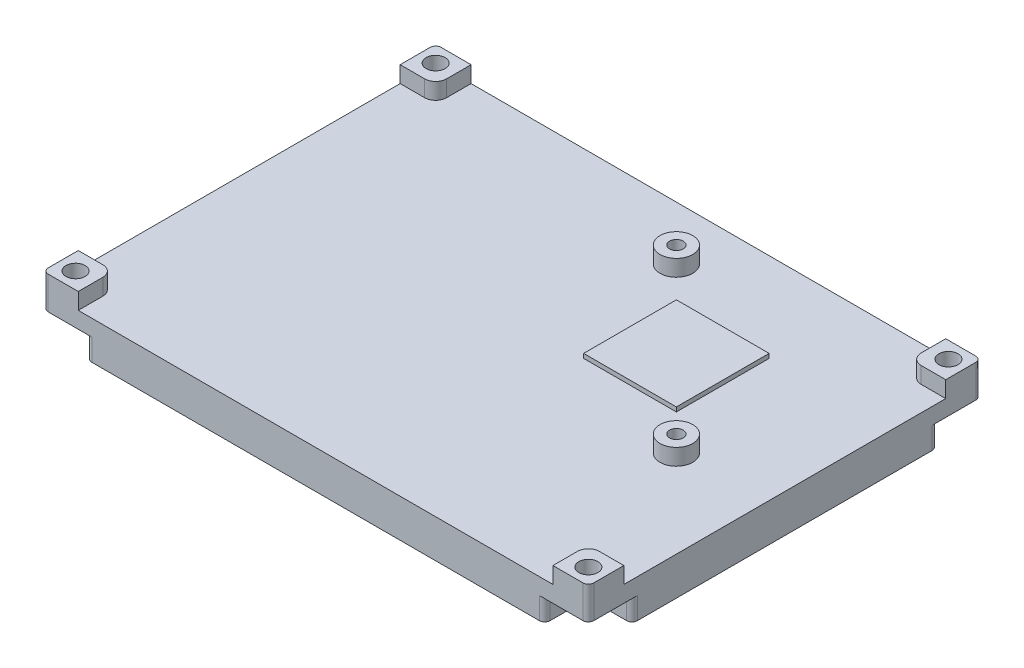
ISO-10303-21;
HEADER;
FILE_DESCRIPTION(('STEP AP214'),'2;1');
FILE_NAME('part.step','',(''),(''),'','','');
FILE_SCHEMA(('AUTOMOTIVE_DESIGN { 1 0 10303 214 1 1 1 1 }'));
ENDSEC;
DATA;
#1=APPLICATION_CONTEXT('core data for automotive mechanical design processes');
#2=APPLICATION_PROTOCOL_DEFINITION('international standard','automotive_design',2000,#1);
#3=PRODUCT_CONTEXT('',#1,'mechanical');
#4=PRODUCT('Part','Part','',(#3));
#5=PRODUCT_RELATED_PRODUCT_CATEGORY('part','',(#4));
#6=PRODUCT_DEFINITION_FORMATION('','',#4);
#7=PRODUCT_DEFINITION_CONTEXT('part definition',#1,'design');
#8=PRODUCT_DEFINITION('design','',#6,#7);
#9=PRODUCT_DEFINITION_SHAPE('','',#8);
#10=(LENGTH_UNIT() NAMED_UNIT(*) SI_UNIT(.MILLI.,.METRE.));
#11=(NAMED_UNIT(*) PLANE_ANGLE_UNIT() SI_UNIT($,.RADIAN.));
#12=(NAMED_UNIT(*) SI_UNIT($,.STERADIAN.) SOLID_ANGLE_UNIT());
#13=UNCERTAINTY_MEASURE_WITH_UNIT(LENGTH_MEASURE(1.E-05),#10,'distance_accuracy_value','');
#14=(GEOMETRIC_REPRESENTATION_CONTEXT(3) GLOBAL_UNCERTAINTY_ASSIGNED_CONTEXT((#13)) GLOBAL_UNIT_ASSIGNED_CONTEXT((#10,
#11,#12)) REPRESENTATION_CONTEXT('',''));
#15=CARTESIAN_POINT('',(0.,0.,0.));
#16=DIRECTION('',(0.,0.,1.));
#17=DIRECTION('',(1.,0.,0.));
#18=AXIS2_PLACEMENT_3D('',#15,#16,#17);
#19=CARTESIAN_POINT('',(97.,10.,-69.));
#20=DIRECTION('',(0.,-1.,0.));
#21=DIRECTION('',(0.,0.,-1.));
#22=AXIS2_PLACEMENT_3D('',#19,#20,#21);
#23=CYLINDRICAL_SURFACE('',#22,1.75);
#24=CARTESIAN_POINT('',(97.,10.,-69.));
#25=DIRECTION('',(0.,1.,0.));
#26=DIRECTION('',(0.,0.,1.));
#27=AXIS2_PLACEMENT_3D('',#24,#25,#26);
#28=CIRCLE('',#27,1.75);
#29=CARTESIAN_POINT('',(97.,10.,-67.25));
#30=VERTEX_POINT('',#29);
#31=EDGE_CURVE('E489',#30,#30,#28,.T.);
#32=ORIENTED_EDGE('',*,*,#31,.T.);
#33=EDGE_LOOP('',(#32));
#34=FACE_BOUND('',#33,.T.);
#35=CARTESIAN_POINT('',(97.,4.,-69.));
#36=DIRECTION('',(0.,-1.,0.));
#37=DIRECTION('',(0.,0.,-1.));
#38=AXIS2_PLACEMENT_3D('',#35,#36,#37);
#39=CIRCLE('',#38,1.75);
#40=CARTESIAN_POINT('',(97.,4.,-70.75));
#41=VERTEX_POINT('',#40);
#42=EDGE_CURVE('E527',#41,#41,#39,.T.);
#43=ORIENTED_EDGE('',*,*,#42,.T.);
#44=EDGE_LOOP('',(#43));
#45=FACE_BOUND('',#44,.T.);
#46=ADVANCED_FACE('F45',(#34,#45),#23,.F.);
#47=CARTESIAN_POINT('',(3.,10.,-3.));
#48=DIRECTION('',(0.,-1.,0.));
#49=DIRECTION('',(0.,0.,-1.));
#50=AXIS2_PLACEMENT_3D('',#47,#48,#49);
#51=CYLINDRICAL_SURFACE('',#50,1.75);
#52=CARTESIAN_POINT('',(3.,10.,-3.));
#53=DIRECTION('',(0.,1.,0.));
#54=DIRECTION('',(0.,0.,1.));
#55=AXIS2_PLACEMENT_3D('',#52,#53,#54);
#56=CIRCLE('',#55,1.75);
#57=CARTESIAN_POINT('',(3.,10.,-1.25));
#58=VERTEX_POINT('',#57);
#59=EDGE_CURVE('E466',#58,#58,#56,.T.);
#60=ORIENTED_EDGE('',*,*,#59,.T.);
#61=EDGE_LOOP('',(#60));
#62=FACE_BOUND('',#61,.T.);
#63=CARTESIAN_POINT('',(3.,4.,-3.));
#64=DIRECTION('',(0.,-1.,0.));
#65=DIRECTION('',(0.,0.,-1.));
#66=AXIS2_PLACEMENT_3D('',#63,#64,#65);
#67=CIRCLE('',#66,1.75);
#68=CARTESIAN_POINT('',(3.,4.,-4.75));
#69=VERTEX_POINT('',#68);
#70=EDGE_CURVE('E520',#69,#69,#67,.T.);
#71=ORIENTED_EDGE('',*,*,#70,.T.);
#72=EDGE_LOOP('',(#71));
#73=FACE_BOUND('',#72,.T.);
#74=ADVANCED_FACE('F942',(#62,#73),#51,.F.);
#75=CARTESIAN_POINT('',(60.44,7.,-55.69));
#76=DIRECTION('',(-1.,0.,0.));
#77=DIRECTION('',(0.,0.,1.));
#78=AXIS2_PLACEMENT_3D('',#75,#76,#77);
#79=PLANE('',#78);
#80=DIRECTION('',(0.,1.,0.));
#81=VECTOR('',#80,1.);
#82=CARTESIAN_POINT('',(60.44,7.,-38.69));
#83=LINE('',#82,#81);
#84=CARTESIAN_POINT('',(60.44,7.,-38.69));
#85=VERTEX_POINT('',#84);
#86=CARTESIAN_POINT('',(60.44,7.8,-38.69));
#87=VERTEX_POINT('',#86);
#88=EDGE_CURVE('E399',#85,#87,#83,.T.);
#89=ORIENTED_EDGE('',*,*,#88,.T.);
#90=DIRECTION('',(0.,0.,1.));
#91=VECTOR('',#90,1.);
#92=CARTESIAN_POINT('',(60.44,7.8,-55.69));
#93=LINE('',#92,#91);
#94=CARTESIAN_POINT('',(60.44,7.8,-55.69));
#95=VERTEX_POINT('',#94);
#96=EDGE_CURVE('E381',#95,#87,#93,.T.);
#97=ORIENTED_EDGE('',*,*,#96,.F.);
#98=DIRECTION('',(0.,1.,0.));
#99=VECTOR('',#98,1.);
#100=CARTESIAN_POINT('',(60.44,7.,-55.69));
#101=LINE('',#100,#99);
#102=CARTESIAN_POINT('',(60.44,7.,-55.69));
#103=VERTEX_POINT('',#102);
#104=EDGE_CURVE('E401',#103,#95,#101,.T.);
#105=ORIENTED_EDGE('',*,*,#104,.F.);
#106=DIRECTION('',(0.,0.,1.));
#107=VECTOR('',#106,1.);
#108=CARTESIAN_POINT('',(60.44,7.,-55.69));
#109=LINE('',#108,#107);
#110=EDGE_CURVE('E816',#103,#85,#109,.T.);
#111=ORIENTED_EDGE('',*,*,#110,.T.);
#112=EDGE_LOOP('',(#89,#97,#105,#111));
#113=FACE_BOUND('',#112,.T.);
#114=ADVANCED_FACE('F831',(#113),#79,.T.);
#115=CARTESIAN_POINT('',(60.44,7.,-55.69));
#116=DIRECTION('',(0.,0.,-1.));
#117=DIRECTION('',(-1.,0.,0.));
#118=AXIS2_PLACEMENT_3D('',#115,#116,#117);
#119=PLANE('',#118);
#120=ORIENTED_EDGE('',*,*,#104,.T.);
#121=DIRECTION('',(-1.,0.,0.));
#122=VECTOR('',#121,1.);
#123=CARTESIAN_POINT('',(60.44,7.8,-55.69));
#124=LINE('',#123,#122);
#125=CARTESIAN_POINT('',(77.44,7.8,-55.69));
#126=VERTEX_POINT('',#125);
#127=EDGE_CURVE('E394',#126,#95,#124,.T.);
#128=ORIENTED_EDGE('',*,*,#127,.F.);
#129=DIRECTION('',(0.,1.,0.));
#130=VECTOR('',#129,1.);
#131=CARTESIAN_POINT('',(77.44,7.,-55.69));
#132=LINE('',#131,#130);
#133=CARTESIAN_POINT('',(77.44,7.,-55.69));
#134=VERTEX_POINT('',#133);
#135=EDGE_CURVE('E393',#134,#126,#132,.T.);
#136=ORIENTED_EDGE('',*,*,#135,.F.);
#137=DIRECTION('',(-1.,0.,0.));
#138=VECTOR('',#137,1.);
#139=CARTESIAN_POINT('',(60.44,7.,-55.69));
#140=LINE('',#139,#138);
#141=EDGE_CURVE('E403',#134,#103,#140,.T.);
#142=ORIENTED_EDGE('',*,*,#141,.T.);
#143=EDGE_LOOP('',(#120,#128,#136,#142));
#144=FACE_BOUND('',#143,.T.);
#145=ADVANCED_FACE('F827',(#144),#119,.T.);
#146=CARTESIAN_POINT('',(77.44,7.,-55.69));
#147=DIRECTION('',(1.,0.,0.));
#148=DIRECTION('',(0.,0.,-1.));
#149=AXIS2_PLACEMENT_3D('',#146,#147,#148);
#150=PLANE('',#149);
#151=ORIENTED_EDGE('',*,*,#135,.T.);
#152=DIRECTION('',(0.,0.,-1.));
#153=VECTOR('',#152,1.);
#154=CARTESIAN_POINT('',(77.44,7.8,-55.69));
#155=LINE('',#154,#153);
#156=CARTESIAN_POINT('',(77.44,7.8,-38.69));
#157=VERTEX_POINT('',#156);
#158=EDGE_CURVE('E378',#157,#126,#155,.T.);
#159=ORIENTED_EDGE('',*,*,#158,.F.);
#160=DIRECTION('',(0.,1.,0.));
#161=VECTOR('',#160,1.);
#162=CARTESIAN_POINT('',(77.44,7.,-38.69));
#163=LINE('',#162,#161);
#164=CARTESIAN_POINT('',(77.44,7.,-38.69));
#165=VERTEX_POINT('',#164);
#166=EDGE_CURVE('E391',#165,#157,#163,.T.);
#167=ORIENTED_EDGE('',*,*,#166,.F.);
#168=DIRECTION('',(0.,0.,-1.));
#169=VECTOR('',#168,1.);
#170=CARTESIAN_POINT('',(77.44,7.,-55.69));
#171=LINE('',#170,#169);
#172=EDGE_CURVE('E822',#165,#134,#171,.T.);
#173=ORIENTED_EDGE('',*,*,#172,.T.);
#174=EDGE_LOOP('',(#151,#159,#167,#173));
#175=FACE_BOUND('',#174,.T.);
#176=ADVANCED_FACE('F389',(#175),#150,.T.);
#177=CARTESIAN_POINT('',(60.44,7.,-38.69));
#178=DIRECTION('',(0.,0.,1.));
#179=DIRECTION('',(1.,0.,0.));
#180=AXIS2_PLACEMENT_3D('',#177,#178,#179);
#181=PLANE('',#180);
#182=ORIENTED_EDGE('',*,*,#166,.T.);
#183=DIRECTION('',(1.,0.,0.));
#184=VECTOR('',#183,1.);
#185=CARTESIAN_POINT('',(60.44,7.8,-38.69));
#186=LINE('',#185,#184);
#187=EDGE_CURVE('E375',#87,#157,#186,.T.);
#188=ORIENTED_EDGE('',*,*,#187,.F.);
#189=ORIENTED_EDGE('',*,*,#88,.F.);
#190=DIRECTION('',(1.,0.,0.));
#191=VECTOR('',#190,1.);
#192=CARTESIAN_POINT('',(60.44,7.,-38.69));
#193=LINE('',#192,#191);
#194=EDGE_CURVE('E398',#85,#165,#193,.T.);
#195=ORIENTED_EDGE('',*,*,#194,.T.);
#196=EDGE_LOOP('',(#182,#188,#189,#195));
#197=FACE_BOUND('',#196,.T.);
#198=ADVANCED_FACE('F396',(#197),#181,.T.);
#199=CARTESIAN_POINT('',(0.,10.,0.));
#200=DIRECTION('',(0.,-1.,0.));
#201=DIRECTION('',(0.,0.,-1.));
#202=AXIS2_PLACEMENT_3D('',#199,#200,#201);
#203=PLANE('',#202);
#204=ORIENTED_EDGE('',*,*,#31,.F.);
#205=EDGE_LOOP('',(#204));
#206=FACE_BOUND('',#205,.T.);
#207=DIRECTION('',(0.,0.,-1.));
#208=VECTOR('',#207,1.);
#209=CARTESIAN_POINT('',(100.,10.,0.));
#210=LINE('',#209,#208);
#211=CARTESIAN_POINT('',(100.,10.,-65.5));
#212=VERTEX_POINT('',#211);
#213=CARTESIAN_POINT('',(100.,10.,-71.));
#214=VERTEX_POINT('',#213);
#215=EDGE_CURVE('E502',#212,#214,#210,.T.);
#216=ORIENTED_EDGE('',*,*,#215,.T.);
#217=CARTESIAN_POINT('',(99.,10.,-71.));
#218=DIRECTION('',(0.,-1.,0.));
#219=DIRECTION('',(0.,0.,-1.));
#220=AXIS2_PLACEMENT_3D('',#217,#218,#219);
#221=CIRCLE('',#220,1.);
#222=CARTESIAN_POINT('',(99.,10.,-72.));
#223=VERTEX_POINT('',#222);
#224=EDGE_CURVE('E670',#214,#223,#221,.F.);
#225=ORIENTED_EDGE('',*,*,#224,.T.);
#226=DIRECTION('',(-1.,0.,0.));
#227=VECTOR('',#226,1.);
#228=CARTESIAN_POINT('',(0.,10.,-72.));
#229=LINE('',#228,#227);
#230=CARTESIAN_POINT('',(93.5,10.,-72.));
#231=VERTEX_POINT('',#230);
#232=EDGE_CURVE('E506',#223,#231,#229,.T.);
#233=ORIENTED_EDGE('',*,*,#232,.T.);
#234=DIRECTION('',(0.,0.,-1.));
#235=VECTOR('',#234,1.);
#236=CARTESIAN_POINT('',(93.5,10.,-72.));
#237=LINE('',#236,#235);
#238=CARTESIAN_POINT('',(93.5,10.,-67.5));
#239=VERTEX_POINT('',#238);
#240=EDGE_CURVE('E411',#239,#231,#237,.T.);
#241=ORIENTED_EDGE('',*,*,#240,.F.);
#242=CARTESIAN_POINT('',(95.5,10.,-67.5));
#243=DIRECTION('',(0.,-1.,0.));
#244=DIRECTION('',(0.,0.,-1.));
#245=AXIS2_PLACEMENT_3D('',#242,#243,#244);
#246=CIRCLE('',#245,2.);
#247=CARTESIAN_POINT('',(95.5,10.,-65.5));
#248=VERTEX_POINT('',#247);
#249=EDGE_CURVE('E549',#239,#248,#246,.F.);
#250=ORIENTED_EDGE('',*,*,#249,.T.);
#251=DIRECTION('',(-1.,0.,0.));
#252=VECTOR('',#251,1.);
#253=CARTESIAN_POINT('',(93.5,10.,-65.5));
#254=LINE('',#253,#252);
#255=EDGE_CURVE('E459',#212,#248,#254,.T.);
#256=ORIENTED_EDGE('',*,*,#255,.F.);
#257=EDGE_LOOP('',(#216,#225,#233,#241,#250,#256));
#258=FACE_BOUND('',#257,.T.);
#259=ADVANCED_FACE('F962',(#206,#258),#203,.F.);
#260=CARTESIAN_POINT('',(97.,10.,-3.));
#261=DIRECTION('',(0.,1.,0.));
#262=DIRECTION('',(0.,0.,1.));
#263=AXIS2_PLACEMENT_3D('',#260,#261,#262);
#264=CIRCLE('',#263,1.75);
#265=CARTESIAN_POINT('',(97.,10.,-1.25));
#266=VERTEX_POINT('',#265);
#267=EDGE_CURVE('E486',#266,#266,#264,.T.);
#268=ORIENTED_EDGE('',*,*,#267,.F.);
#269=EDGE_LOOP('',(#268));
#270=FACE_BOUND('',#269,.T.);
#271=DIRECTION('',(1.,0.,0.));
#272=VECTOR('',#271,1.);
#273=CARTESIAN_POINT('',(0.,10.,0.));
#274=LINE('',#273,#272);
#275=CARTESIAN_POINT('',(93.5,10.,0.));
#276=VERTEX_POINT('',#275);
#277=CARTESIAN_POINT('',(99.,10.,0.));
#278=VERTEX_POINT('',#277);
#279=EDGE_CURVE('E498',#276,#278,#274,.T.);
#280=ORIENTED_EDGE('',*,*,#279,.T.);
#281=CARTESIAN_POINT('',(99.,10.,-1.));
#282=DIRECTION('',(0.,-1.,0.));
#283=DIRECTION('',(0.,0.,-1.));
#284=AXIS2_PLACEMENT_3D('',#281,#282,#283);
#285=CIRCLE('',#284,1.);
#286=CARTESIAN_POINT('',(100.,10.,-1.));
#287=VERTEX_POINT('',#286);
#288=EDGE_CURVE('E666',#278,#287,#285,.F.);
#289=ORIENTED_EDGE('',*,*,#288,.T.);
#290=CARTESIAN_POINT('',(100.,10.,-6.5));
#291=VERTEX_POINT('',#290);
#292=EDGE_CURVE('E503',#287,#291,#210,.T.);
#293=ORIENTED_EDGE('',*,*,#292,.T.);
#294=DIRECTION('',(1.,0.,0.));
#295=VECTOR('',#294,1.);
#296=CARTESIAN_POINT('',(93.5,10.,-6.5));
#297=LINE('',#296,#295);
#298=CARTESIAN_POINT('',(95.5,10.,-6.5));
#299=VERTEX_POINT('',#298);
#300=EDGE_CURVE('E456',#299,#291,#297,.T.);
#301=ORIENTED_EDGE('',*,*,#300,.F.);
#302=CARTESIAN_POINT('',(95.5,10.,-4.5));
#303=DIRECTION('',(0.,-1.,0.));
#304=DIRECTION('',(0.,0.,-1.));
#305=AXIS2_PLACEMENT_3D('',#302,#303,#304);
#306=CIRCLE('',#305,2.);
#307=CARTESIAN_POINT('',(93.5,10.,-4.50000000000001));
#308=VERTEX_POINT('',#307);
#309=EDGE_CURVE('E542',#299,#308,#306,.F.);
#310=ORIENTED_EDGE('',*,*,#309,.T.);
#311=DIRECTION('',(0.,0.,-1.));
#312=VECTOR('',#311,1.);
#313=CARTESIAN_POINT('',(93.5,10.,-6.5));
#314=LINE('',#313,#312);
#315=EDGE_CURVE('E453',#276,#308,#314,.T.);
#316=ORIENTED_EDGE('',*,*,#315,.F.);
#317=EDGE_LOOP('',(#280,#289,#293,#301,#310,#316));
#318=FACE_BOUND('',#317,.T.);
#319=ADVANCED_FACE('F1352',(#270,#318),#203,.F.);
#320=ORIENTED_EDGE('',*,*,#59,.F.);
#321=EDGE_LOOP('',(#320));
#322=FACE_BOUND('',#321,.T.);
#323=DIRECTION('',(0.,0.,1.));
#324=VECTOR('',#323,1.);
#325=CARTESIAN_POINT('',(0.,10.,0.));
#326=LINE('',#325,#324);
#327=CARTESIAN_POINT('',(0.,10.,-6.5));
#328=VERTEX_POINT('',#327);
#329=CARTESIAN_POINT('',(0.,10.,-1.));
#330=VERTEX_POINT('',#329);
#331=EDGE_CURVE('E499',#328,#330,#326,.T.);
#332=ORIENTED_EDGE('',*,*,#331,.T.);
#333=CARTESIAN_POINT('',(1.,10.,-1.));
#334=DIRECTION('',(0.,-1.,0.));
#335=DIRECTION('',(0.,0.,-1.));
#336=AXIS2_PLACEMENT_3D('',#333,#334,#335);
#337=CIRCLE('',#336,1.);
#338=CARTESIAN_POINT('',(1.,10.,0.));
#339=VERTEX_POINT('',#338);
#340=EDGE_CURVE('E636',#330,#339,#337,.F.);
#341=ORIENTED_EDGE('',*,*,#340,.T.);
#342=CARTESIAN_POINT('',(6.49999999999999,10.,0.));
#343=VERTEX_POINT('',#342);
#344=EDGE_CURVE('E500',#339,#343,#274,.T.);
#345=ORIENTED_EDGE('',*,*,#344,.T.);
#346=DIRECTION('',(0.,0.,1.));
#347=VECTOR('',#346,1.);
#348=CARTESIAN_POINT('',(6.49999999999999,10.,-6.5));
#349=LINE('',#348,#347);
#350=CARTESIAN_POINT('',(6.49999999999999,10.,-4.5));
#351=VERTEX_POINT('',#350);
#352=EDGE_CURVE('E450',#351,#343,#349,.T.);
#353=ORIENTED_EDGE('',*,*,#352,.F.);
#354=CARTESIAN_POINT('',(4.49999999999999,10.,-4.5));
#355=DIRECTION('',(0.,-1.,0.));
#356=DIRECTION('',(0.,0.,-1.));
#357=AXIS2_PLACEMENT_3D('',#354,#355,#356);
#358=CIRCLE('',#357,2.);
#359=CARTESIAN_POINT('',(4.49999999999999,10.,-6.5));
#360=VERTEX_POINT('',#359);
#361=EDGE_CURVE('E535',#351,#360,#358,.F.);
#362=ORIENTED_EDGE('',*,*,#361,.T.);
#363=DIRECTION('',(1.,0.,0.));
#364=VECTOR('',#363,1.);
#365=CARTESIAN_POINT('',(0.,10.,-6.5));
#366=LINE('',#365,#364);
#367=EDGE_CURVE('E447',#328,#360,#366,.T.);
#368=ORIENTED_EDGE('',*,*,#367,.F.);
#369=EDGE_LOOP('',(#332,#341,#345,#353,#362,#368));
#370=FACE_BOUND('',#369,.T.);
#371=ADVANCED_FACE('F961',(#322,#370),#203,.F.);
#372=CARTESIAN_POINT('',(6.50000000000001,10.,-72.));
#373=VERTEX_POINT('',#372);
#374=CARTESIAN_POINT('',(1.,10.,-72.));
#375=VERTEX_POINT('',#374);
#376=EDGE_CURVE('E505',#373,#375,#229,.T.);
#377=ORIENTED_EDGE('',*,*,#376,.T.);
#378=CARTESIAN_POINT('',(1.,10.,-71.));
#379=DIRECTION('',(0.,-1.,0.));
#380=DIRECTION('',(0.,0.,-1.));
#381=AXIS2_PLACEMENT_3D('',#378,#379,#380);
#382=CIRCLE('',#381,1.);
#383=CARTESIAN_POINT('',(0.,10.,-71.));
#384=VERTEX_POINT('',#383);
#385=EDGE_CURVE('E651',#375,#384,#382,.F.);
#386=ORIENTED_EDGE('',*,*,#385,.T.);
#387=CARTESIAN_POINT('',(0.,10.,-65.5));
#388=VERTEX_POINT('',#387);
#389=EDGE_CURVE('E496',#384,#388,#326,.T.);
#390=ORIENTED_EDGE('',*,*,#389,.T.);
#391=DIRECTION('',(-1.,0.,0.));
#392=VECTOR('',#391,1.);
#393=CARTESIAN_POINT('',(0.,10.,-65.5));
#394=LINE('',#393,#392);
#395=CARTESIAN_POINT('',(4.5,10.,-65.5));
#396=VERTEX_POINT('',#395);
#397=EDGE_CURVE('E444',#396,#388,#394,.T.);
#398=ORIENTED_EDGE('',*,*,#397,.F.);
#399=CARTESIAN_POINT('',(4.5,10.,-67.5));
#400=DIRECTION('',(0.,-1.,0.));
#401=DIRECTION('',(0.,0.,-1.));
#402=AXIS2_PLACEMENT_3D('',#399,#400,#401);
#403=CIRCLE('',#402,2.);
#404=CARTESIAN_POINT('',(6.5,10.,-67.5));
#405=VERTEX_POINT('',#404);
#406=EDGE_CURVE('E556',#396,#405,#403,.F.);
#407=ORIENTED_EDGE('',*,*,#406,.T.);
#408=DIRECTION('',(0.,0.,1.));
#409=VECTOR('',#408,1.);
#410=CARTESIAN_POINT('',(6.50000000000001,10.,-72.));
#411=LINE('',#410,#409);
#412=EDGE_CURVE('E441',#373,#405,#411,.T.);
#413=ORIENTED_EDGE('',*,*,#412,.F.);
#414=EDGE_LOOP('',(#377,#386,#390,#398,#407,#413));
#415=FACE_BOUND('',#414,.T.);
#416=CARTESIAN_POINT('',(3.,10.,-69.));
#417=DIRECTION('',(0.,1.,0.));
#418=DIRECTION('',(0.,0.,1.));
#419=AXIS2_PLACEMENT_3D('',#416,#417,#418);
#420=CIRCLE('',#419,1.75);
#421=CARTESIAN_POINT('',(3.,10.,-67.25));
#422=VERTEX_POINT('',#421);
#423=EDGE_CURVE('E492',#422,#422,#420,.T.);
#424=ORIENTED_EDGE('',*,*,#423,.F.);
#425=EDGE_LOOP('',(#424));
#426=FACE_BOUND('',#425,.T.);
#427=ADVANCED_FACE('F854',(#415,#426),#203,.F.);
#428=CARTESIAN_POINT('',(0.,0.,0.));
#429=DIRECTION('',(0.,-1.,0.));
#430=DIRECTION('',(0.,0.,-1.));
#431=AXIS2_PLACEMENT_3D('',#428,#429,#430);
#432=PLANE('',#431);
#433=DIRECTION('',(1.,0.,0.));
#434=VECTOR('',#433,1.);
#435=CARTESIAN_POINT('',(0.,0.,-8.));
#436=LINE('',#435,#434);
#437=CARTESIAN_POINT('',(1.,0.,-8.));
#438=VERTEX_POINT('',#437);
#439=CARTESIAN_POINT('',(6.,0.,-8.));
#440=VERTEX_POINT('',#439);
#441=EDGE_CURVE('E761',#438,#440,#436,.T.);
#442=ORIENTED_EDGE('',*,*,#441,.F.);
#443=CARTESIAN_POINT('',(1.,0.,-9.));
#444=DIRECTION('',(0.,-1.,0.));
#445=DIRECTION('',(0.,0.,-1.));
#446=AXIS2_PLACEMENT_3D('',#443,#444,#445);
#447=CIRCLE('',#446,1.);
#448=CARTESIAN_POINT('',(0.,0.,-9.));
#449=VERTEX_POINT('',#448);
#450=EDGE_CURVE('E687',#438,#449,#447,.T.);
#451=ORIENTED_EDGE('',*,*,#450,.T.);
#452=DIRECTION('',(0.,0.,1.));
#453=VECTOR('',#452,1.);
#454=CARTESIAN_POINT('',(0.,0.,0.));
#455=LINE('',#454,#453);
#456=CARTESIAN_POINT('',(0.,0.,-63.));
#457=VERTEX_POINT('',#456);
#458=EDGE_CURVE('E495',#457,#449,#455,.T.);
#459=ORIENTED_EDGE('',*,*,#458,.F.);
#460=CARTESIAN_POINT('',(1.,0.,-63.));
#461=DIRECTION('',(0.,-1.,0.));
#462=DIRECTION('',(0.,0.,-1.));
#463=AXIS2_PLACEMENT_3D('',#460,#461,#462);
#464=CIRCLE('',#463,1.);
#465=CARTESIAN_POINT('',(1.,0.,-64.));
#466=VERTEX_POINT('',#465);
#467=EDGE_CURVE('E681',#457,#466,#464,.T.);
#468=ORIENTED_EDGE('',*,*,#467,.T.);
#469=DIRECTION('',(-1.,0.,0.));
#470=VECTOR('',#469,1.);
#471=CARTESIAN_POINT('',(0.,0.,-64.));
#472=LINE('',#471,#470);
#473=CARTESIAN_POINT('',(6.00000000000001,0.,-64.));
#474=VERTEX_POINT('',#473);
#475=EDGE_CURVE('E882',#474,#466,#472,.T.);
#476=ORIENTED_EDGE('',*,*,#475,.F.);
#477=CARTESIAN_POINT('',(6.00000000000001,0.,-66.));
#478=DIRECTION('',(0.,-1.,0.));
#479=DIRECTION('',(0.,0.,-1.));
#480=AXIS2_PLACEMENT_3D('',#477,#478,#479);
#481=CIRCLE('',#480,2.);
#482=CARTESIAN_POINT('',(8.00000000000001,0.,-66.));
#483=VERTEX_POINT('',#482);
#484=EDGE_CURVE('E603',#474,#483,#481,.F.);
#485=ORIENTED_EDGE('',*,*,#484,.T.);
#486=DIRECTION('',(0.,0.,1.));
#487=VECTOR('',#486,1.);
#488=CARTESIAN_POINT('',(8.00000000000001,0.,-72.));
#489=LINE('',#488,#487);
#490=CARTESIAN_POINT('',(8.00000000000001,0.,-71.));
#491=VERTEX_POINT('',#490);
#492=EDGE_CURVE('E888',#491,#483,#489,.T.);
#493=ORIENTED_EDGE('',*,*,#492,.F.);
#494=CARTESIAN_POINT('',(9.00000000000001,0.,-71.));
#495=DIRECTION('',(0.,-1.,0.));
#496=DIRECTION('',(0.,0.,-1.));
#497=AXIS2_PLACEMENT_3D('',#494,#495,#496);
#498=CIRCLE('',#497,1.);
#499=CARTESIAN_POINT('',(9.00000000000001,0.,-72.));
#500=VERTEX_POINT('',#499);
#501=EDGE_CURVE('E683',#491,#500,#498,.T.);
#502=ORIENTED_EDGE('',*,*,#501,.T.);
#503=DIRECTION('',(-1.,0.,0.));
#504=VECTOR('',#503,1.);
#505=CARTESIAN_POINT('',(0.,0.,-72.));
#506=LINE('',#505,#504);
#507=CARTESIAN_POINT('',(91.,0.,-72.));
#508=VERTEX_POINT('',#507);
#509=EDGE_CURVE('E517',#508,#500,#506,.T.);
#510=ORIENTED_EDGE('',*,*,#509,.F.);
#511=CARTESIAN_POINT('',(91.,0.,-71.));
#512=DIRECTION('',(0.,-1.,0.));
#513=DIRECTION('',(0.,0.,-1.));
#514=AXIS2_PLACEMENT_3D('',#511,#512,#513);
#515=CIRCLE('',#514,1.);
#516=CARTESIAN_POINT('',(92.,0.,-71.));
#517=VERTEX_POINT('',#516);
#518=EDGE_CURVE('E68',#508,#517,#515,.T.);
#519=ORIENTED_EDGE('',*,*,#518,.T.);
#520=DIRECTION('',(0.,0.,-1.));
#521=VECTOR('',#520,1.);
#522=CARTESIAN_POINT('',(92.,0.,-72.));
#523=LINE('',#522,#521);
#524=CARTESIAN_POINT('',(92.,0.,-66.));
#525=VERTEX_POINT('',#524);
#526=EDGE_CURVE('E1074',#525,#517,#523,.T.);
#527=ORIENTED_EDGE('',*,*,#526,.F.);
#528=CARTESIAN_POINT('',(94.,0.,-66.));
#529=DIRECTION('',(0.,-1.,0.));
#530=DIRECTION('',(0.,0.,-1.));
#531=AXIS2_PLACEMENT_3D('',#528,#529,#530);
#532=CIRCLE('',#531,2.);
#533=CARTESIAN_POINT('',(94.,0.,-64.));
#534=VERTEX_POINT('',#533);
#535=EDGE_CURVE('E606',#525,#534,#532,.F.);
#536=ORIENTED_EDGE('',*,*,#535,.T.);
#537=DIRECTION('',(-1.,0.,0.));
#538=VECTOR('',#537,1.);
#539=CARTESIAN_POINT('',(100.,0.,-64.));
#540=LINE('',#539,#538);
#541=CARTESIAN_POINT('',(99.,0.,-64.));
#542=VERTEX_POINT('',#541);
#543=EDGE_CURVE('E1077',#542,#534,#540,.T.);
#544=ORIENTED_EDGE('',*,*,#543,.F.);
#545=CARTESIAN_POINT('',(99.,0.,-63.));
#546=DIRECTION('',(0.,-1.,0.));
#547=DIRECTION('',(0.,0.,-1.));
#548=AXIS2_PLACEMENT_3D('',#545,#546,#547);
#549=CIRCLE('',#548,1.);
#550=CARTESIAN_POINT('',(100.,0.,-63.));
#551=VERTEX_POINT('',#550);
#552=EDGE_CURVE('E60',#542,#551,#549,.T.);
#553=ORIENTED_EDGE('',*,*,#552,.T.);
#554=DIRECTION('',(0.,0.,-1.));
#555=VECTOR('',#554,1.);
#556=CARTESIAN_POINT('',(100.,0.,0.));
#557=LINE('',#556,#555);
#558=CARTESIAN_POINT('',(100.,0.,-9.));
#559=VERTEX_POINT('',#558);
#560=EDGE_CURVE('E514',#559,#551,#557,.T.);
#561=ORIENTED_EDGE('',*,*,#560,.F.);
#562=CARTESIAN_POINT('',(99.,0.,-9.));
#563=DIRECTION('',(0.,-1.,0.));
#564=DIRECTION('',(0.,0.,-1.));
#565=AXIS2_PLACEMENT_3D('',#562,#563,#564);
#566=CIRCLE('',#565,1.);
#567=CARTESIAN_POINT('',(99.,0.,-8.));
#568=VERTEX_POINT('',#567);
#569=EDGE_CURVE('E675',#559,#568,#566,.T.);
#570=ORIENTED_EDGE('',*,*,#569,.T.);
#571=DIRECTION('',(1.,0.,0.));
#572=VECTOR('',#571,1.);
#573=CARTESIAN_POINT('',(100.,0.,-8.));
#574=LINE('',#573,#572);
#575=CARTESIAN_POINT('',(94.,0.,-8.));
#576=VERTEX_POINT('',#575);
#577=EDGE_CURVE('E1069',#576,#568,#574,.T.);
#578=ORIENTED_EDGE('',*,*,#577,.F.);
#579=CARTESIAN_POINT('',(94.,0.,-6.));
#580=DIRECTION('',(0.,-1.,0.));
#581=DIRECTION('',(0.,0.,-1.));
#582=AXIS2_PLACEMENT_3D('',#579,#580,#581);
#583=CIRCLE('',#582,2.);
#584=CARTESIAN_POINT('',(92.,0.,-6.));
#585=VERTEX_POINT('',#584);
#586=EDGE_CURVE('E609',#576,#585,#583,.F.);
#587=ORIENTED_EDGE('',*,*,#586,.T.);
#588=DIRECTION('',(0.,0.,-1.));
#589=VECTOR('',#588,1.);
#590=CARTESIAN_POINT('',(92.,0.,0.));
#591=LINE('',#590,#589);
#592=CARTESIAN_POINT('',(92.,0.,-1.));
#593=VERTEX_POINT('',#592);
#594=EDGE_CURVE('E742',#593,#585,#591,.T.);
#595=ORIENTED_EDGE('',*,*,#594,.F.);
#596=CARTESIAN_POINT('',(91.,0.,-1.));
#597=DIRECTION('',(0.,-1.,0.));
#598=DIRECTION('',(0.,0.,-1.));
#599=AXIS2_PLACEMENT_3D('',#596,#597,#598);
#600=CIRCLE('',#599,1.);
#601=CARTESIAN_POINT('',(91.,0.,0.));
#602=VERTEX_POINT('',#601);
#603=EDGE_CURVE('E677',#593,#602,#600,.T.);
#604=ORIENTED_EDGE('',*,*,#603,.T.);
#605=DIRECTION('',(1.,0.,0.));
#606=VECTOR('',#605,1.);
#607=CARTESIAN_POINT('',(0.,0.,0.));
#608=LINE('',#607,#606);
#609=CARTESIAN_POINT('',(9.,0.,0.));
#610=VERTEX_POINT('',#609);
#611=EDGE_CURVE('E511',#610,#602,#608,.T.);
#612=ORIENTED_EDGE('',*,*,#611,.F.);
#613=CARTESIAN_POINT('',(9.,0.,-1.));
#614=DIRECTION('',(0.,-1.,0.));
#615=DIRECTION('',(0.,0.,-1.));
#616=AXIS2_PLACEMENT_3D('',#613,#614,#615);
#617=CIRCLE('',#616,1.);
#618=CARTESIAN_POINT('',(8.,0.,-1.));
#619=VERTEX_POINT('',#618);
#620=EDGE_CURVE('E685',#610,#619,#617,.T.);
#621=ORIENTED_EDGE('',*,*,#620,.T.);
#622=DIRECTION('',(0.,0.,1.));
#623=VECTOR('',#622,1.);
#624=CARTESIAN_POINT('',(8.,0.,0.));
#625=LINE('',#624,#623);
#626=CARTESIAN_POINT('',(8.,0.,-6.));
#627=VERTEX_POINT('',#626);
#628=EDGE_CURVE('E754',#627,#619,#625,.T.);
#629=ORIENTED_EDGE('',*,*,#628,.F.);
#630=CARTESIAN_POINT('',(6.,0.,-6.));
#631=DIRECTION('',(0.,-1.,0.));
#632=DIRECTION('',(0.,0.,-1.));
#633=AXIS2_PLACEMENT_3D('',#630,#631,#632);
#634=CIRCLE('',#633,2.);
#635=EDGE_CURVE('E600',#627,#440,#634,.F.);
#636=ORIENTED_EDGE('',*,*,#635,.T.);
#637=EDGE_LOOP('',(#442,#451,#459,#468,#476,#485,#493,#502,#510,#519,#527,#536,#544,#553,#561,
#570,#578,#587,#595,#604,#612,#621,#629,#636));
#638=FACE_BOUND('',#637,.T.);
#639=CARTESIAN_POINT('',(25.,0.,-61.));
#640=DIRECTION('',(0.,-1.,0.));
#641=DIRECTION('',(0.,0.,-1.));
#642=AXIS2_PLACEMENT_3D('',#639,#640,#641);
#643=CIRCLE('',#642,1.25);
#644=CARTESIAN_POINT('',(25.,0.,-62.25));
#645=VERTEX_POINT('',#644);
#646=EDGE_CURVE('E770',#645,#645,#643,.T.);
#647=ORIENTED_EDGE('',*,*,#646,.F.);
#648=EDGE_LOOP('',(#647));
#649=FACE_BOUND('',#648,.T.);
#650=CARTESIAN_POINT('',(75.,0.,-61.));
#651=DIRECTION('',(0.,-1.,0.));
#652=DIRECTION('',(0.,0.,-1.));
#653=AXIS2_PLACEMENT_3D('',#650,#651,#652);
#654=CIRCLE('',#653,1.25);
#655=CARTESIAN_POINT('',(75.,0.,-62.25));
#656=VERTEX_POINT('',#655);
#657=EDGE_CURVE('E781',#656,#656,#654,.T.);
#658=ORIENTED_EDGE('',*,*,#657,.F.);
#659=EDGE_LOOP('',(#658));
#660=FACE_BOUND('',#659,.T.);
#661=CARTESIAN_POINT('',(75.,0.,-11.));
#662=DIRECTION('',(0.,-1.,0.));
#663=DIRECTION('',(0.,0.,-1.));
#664=AXIS2_PLACEMENT_3D('',#661,#662,#663);
#665=CIRCLE('',#664,1.25);
#666=CARTESIAN_POINT('',(75.,0.,-12.25));
#667=VERTEX_POINT('',#666);
#668=EDGE_CURVE('E775',#667,#667,#665,.T.);
#669=ORIENTED_EDGE('',*,*,#668,.F.);
#670=EDGE_LOOP('',(#669));
#671=FACE_BOUND('',#670,.T.);
#672=CARTESIAN_POINT('',(25.,0.,-11.));
#673=DIRECTION('',(0.,-1.,0.));
#674=DIRECTION('',(0.,0.,-1.));
#675=AXIS2_PLACEMENT_3D('',#672,#673,#674);
#676=CIRCLE('',#675,1.25);
#677=CARTESIAN_POINT('',(25.,0.,-12.25));
#678=VERTEX_POINT('',#677);
#679=EDGE_CURVE('E774',#678,#678,#676,.T.);
#680=ORIENTED_EDGE('',*,*,#679,.F.);
#681=EDGE_LOOP('',(#680));
#682=FACE_BOUND('',#681,.T.);
#683=ADVANCED_FACE('F740',(#638,#649,#660,#671,#682),#432,.T.);
#684=CARTESIAN_POINT('',(0.,10.,0.));
#685=DIRECTION('',(1.,0.,0.));
#686=DIRECTION('',(0.,0.,-1.));
#687=AXIS2_PLACEMENT_3D('',#684,#685,#686);
#688=PLANE('',#687);
#689=DIRECTION('',(0.,0.,-1.));
#690=VECTOR('',#689,1.);
#691=CARTESIAN_POINT('',(0.,4.,0.));
#692=LINE('',#691,#690);
#693=CARTESIAN_POINT('',(0.,4.,-1.));
#694=VERTEX_POINT('',#693);
#695=CARTESIAN_POINT('',(0.,4.,-9.));
#696=VERTEX_POINT('',#695);
#697=EDGE_CURVE('E760',#694,#696,#692,.T.);
#698=ORIENTED_EDGE('',*,*,#697,.F.);
#699=DIRECTION('',(0.,-1.,0.));
#700=VECTOR('',#699,1.);
#701=CARTESIAN_POINT('',(0.,10.,-1.));
#702=LINE('',#701,#700);
#703=EDGE_CURVE('E634',#694,#330,#702,.F.);
#704=ORIENTED_EDGE('',*,*,#703,.T.);
#705=ORIENTED_EDGE('',*,*,#331,.F.);
#706=DIRECTION('',(0.,1.,0.));
#707=VECTOR('',#706,1.);
#708=CARTESIAN_POINT('',(0.,7.,-6.5));
#709=LINE('',#708,#707);
#710=CARTESIAN_POINT('',(0.,7.,-6.5));
#711=VERTEX_POINT('',#710);
#712=EDGE_CURVE('E480',#711,#328,#709,.T.);
#713=ORIENTED_EDGE('',*,*,#712,.F.);
#714=DIRECTION('',(0.,0.,1.));
#715=VECTOR('',#714,1.);
#716=CARTESIAN_POINT('',(0.,7.,-65.5));
#717=LINE('',#716,#715);
#718=CARTESIAN_POINT('',(0.,7.,-65.5));
#719=VERTEX_POINT('',#718);
#720=EDGE_CURVE('E413',#719,#711,#717,.T.);
#721=ORIENTED_EDGE('',*,*,#720,.F.);
#722=DIRECTION('',(0.,1.,0.));
#723=VECTOR('',#722,1.);
#724=CARTESIAN_POINT('',(0.,7.,-65.5));
#725=LINE('',#724,#723);
#726=EDGE_CURVE('E440',#719,#388,#725,.T.);
#727=ORIENTED_EDGE('',*,*,#726,.T.);
#728=ORIENTED_EDGE('',*,*,#389,.F.);
#729=DIRECTION('',(0.,-1.,0.));
#730=VECTOR('',#729,1.);
#731=CARTESIAN_POINT('',(0.,10.,-71.));
#732=LINE('',#731,#730);
#733=CARTESIAN_POINT('',(0.,4.,-71.));
#734=VERTEX_POINT('',#733);
#735=EDGE_CURVE('E631',#384,#734,#732,.T.);
#736=ORIENTED_EDGE('',*,*,#735,.T.);
#737=DIRECTION('',(0.,0.,-1.));
#738=VECTOR('',#737,1.);
#739=CARTESIAN_POINT('',(0.,4.,-72.));
#740=LINE('',#739,#738);
#741=CARTESIAN_POINT('',(0.,4.,-63.));
#742=VERTEX_POINT('',#741);
#743=EDGE_CURVE('E872',#742,#734,#740,.T.);
#744=ORIENTED_EDGE('',*,*,#743,.F.);
#745=DIRECTION('',(0.,-1.,0.));
#746=VECTOR('',#745,1.);
#747=CARTESIAN_POINT('',(0.,10.,-63.));
#748=LINE('',#747,#746);
#749=EDGE_CURVE('E625',#742,#457,#748,.T.);
#750=ORIENTED_EDGE('',*,*,#749,.T.);
#751=ORIENTED_EDGE('',*,*,#458,.T.);
#752=DIRECTION('',(0.,-1.,0.));
#753=VECTOR('',#752,1.);
#754=CARTESIAN_POINT('',(0.,10.,-9.));
#755=LINE('',#754,#753);
#756=EDGE_CURVE('E628',#449,#696,#755,.F.);
#757=ORIENTED_EDGE('',*,*,#756,.T.);
#758=EDGE_LOOP('',(#698,#704,#705,#713,#721,#727,#728,#736,#744,#750,#751,#757));
#759=FACE_BOUND('',#758,.T.);
#760=ADVANCED_FACE('F862',(#759),#688,.F.);
#761=CARTESIAN_POINT('',(0.,10.,0.));
#762=DIRECTION('',(0.,0.,-1.));
#763=DIRECTION('',(-1.,0.,0.));
#764=AXIS2_PLACEMENT_3D('',#761,#762,#763);
#765=PLANE('',#764);
#766=ORIENTED_EDGE('',*,*,#344,.F.);
#767=DIRECTION('',(0.,-1.,0.));
#768=VECTOR('',#767,1.);
#769=CARTESIAN_POINT('',(1.,10.,0.));
#770=LINE('',#769,#768);
#771=CARTESIAN_POINT('',(1.,4.,0.));
#772=VERTEX_POINT('',#771);
#773=EDGE_CURVE('E620',#339,#772,#770,.T.);
#774=ORIENTED_EDGE('',*,*,#773,.T.);
#775=DIRECTION('',(-1.,0.,0.));
#776=VECTOR('',#775,1.);
#777=CARTESIAN_POINT('',(0.,4.,0.));
#778=LINE('',#777,#776);
#779=CARTESIAN_POINT('',(9.,4.,0.));
#780=VERTEX_POINT('',#779);
#781=EDGE_CURVE('E524',#780,#772,#778,.T.);
#782=ORIENTED_EDGE('',*,*,#781,.F.);
#783=DIRECTION('',(0.,-1.,0.));
#784=VECTOR('',#783,1.);
#785=CARTESIAN_POINT('',(9.,10.,0.));
#786=LINE('',#785,#784);
#787=EDGE_CURVE('E615',#780,#610,#786,.T.);
#788=ORIENTED_EDGE('',*,*,#787,.T.);
#789=ORIENTED_EDGE('',*,*,#611,.T.);
#790=DIRECTION('',(0.,-1.,0.));
#791=VECTOR('',#790,1.);
#792=CARTESIAN_POINT('',(91.,10.,0.));
#793=LINE('',#792,#791);
#794=CARTESIAN_POINT('',(91.,4.,0.));
#795=VERTEX_POINT('',#794);
#796=EDGE_CURVE('E612',#602,#795,#793,.F.);
#797=ORIENTED_EDGE('',*,*,#796,.T.);
#798=DIRECTION('',(-1.,0.,0.));
#799=VECTOR('',#798,1.);
#800=CARTESIAN_POINT('',(100.,4.,0.));
#801=LINE('',#800,#799);
#802=CARTESIAN_POINT('',(99.,4.,0.));
#803=VERTEX_POINT('',#802);
#804=EDGE_CURVE('E726',#803,#795,#801,.T.);
#805=ORIENTED_EDGE('',*,*,#804,.F.);
#806=DIRECTION('',(0.,-1.,0.));
#807=VECTOR('',#806,1.);
#808=CARTESIAN_POINT('',(99.,10.,0.));
#809=LINE('',#808,#807);
#810=EDGE_CURVE('E618',#803,#278,#809,.F.);
#811=ORIENTED_EDGE('',*,*,#810,.T.);
#812=ORIENTED_EDGE('',*,*,#279,.F.);
#813=DIRECTION('',(0.,1.,0.));
#814=VECTOR('',#813,1.);
#815=CARTESIAN_POINT('',(93.5,7.,0.));
#816=LINE('',#815,#814);
#817=CARTESIAN_POINT('',(93.5,7.,0.));
#818=VERTEX_POINT('',#817);
#819=EDGE_CURVE('E475',#818,#276,#816,.T.);
#820=ORIENTED_EDGE('',*,*,#819,.F.);
#821=DIRECTION('',(1.,0.,0.));
#822=VECTOR('',#821,1.);
#823=CARTESIAN_POINT('',(6.49999999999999,7.,0.));
#824=LINE('',#823,#822);
#825=CARTESIAN_POINT('',(6.49999999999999,7.,0.));
#826=VERTEX_POINT('',#825);
#827=EDGE_CURVE('E421',#826,#818,#824,.T.);
#828=ORIENTED_EDGE('',*,*,#827,.F.);
#829=DIRECTION('',(0.,1.,0.));
#830=VECTOR('',#829,1.);
#831=CARTESIAN_POINT('',(6.49999999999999,7.,0.));
#832=LINE('',#831,#830);
#833=EDGE_CURVE('E477',#826,#343,#832,.T.);
#834=ORIENTED_EDGE('',*,*,#833,.T.);
#835=EDGE_LOOP('',(#766,#774,#782,#788,#789,#797,#805,#811,#812,#820,#828,#834));
#836=FACE_BOUND('',#835,.T.);
#837=ADVANCED_FACE('F745',(#836),#765,.F.);
#838=CARTESIAN_POINT('',(100.,10.,0.));
#839=DIRECTION('',(-1.,0.,0.));
#840=DIRECTION('',(0.,0.,1.));
#841=AXIS2_PLACEMENT_3D('',#838,#839,#840);
#842=PLANE('',#841);
#843=ORIENTED_EDGE('',*,*,#292,.F.);
#844=DIRECTION('',(0.,-1.,0.));
#845=VECTOR('',#844,1.);
#846=CARTESIAN_POINT('',(100.,10.,-1.));
#847=LINE('',#846,#845);
#848=CARTESIAN_POINT('',(100.,4.,-1.));
#849=VERTEX_POINT('',#848);
#850=EDGE_CURVE('E661',#287,#849,#847,.T.);
#851=ORIENTED_EDGE('',*,*,#850,.T.);
#852=DIRECTION('',(0.,0.,1.));
#853=VECTOR('',#852,1.);
#854=CARTESIAN_POINT('',(100.,4.,0.));
#855=LINE('',#854,#853);
#856=CARTESIAN_POINT('',(100.,4.,-9.));
#857=VERTEX_POINT('',#856);
#858=EDGE_CURVE('E1062',#857,#849,#855,.T.);
#859=ORIENTED_EDGE('',*,*,#858,.F.);
#860=DIRECTION('',(0.,-1.,0.));
#861=VECTOR('',#860,1.);
#862=CARTESIAN_POINT('',(100.,10.,-9.));
#863=LINE('',#862,#861);
#864=EDGE_CURVE('E653',#857,#559,#863,.T.);
#865=ORIENTED_EDGE('',*,*,#864,.T.);
#866=ORIENTED_EDGE('',*,*,#560,.T.);
#867=DIRECTION('',(0.,-1.,0.));
#868=VECTOR('',#867,1.);
#869=CARTESIAN_POINT('',(100.,10.,-63.));
#870=LINE('',#869,#868);
#871=CARTESIAN_POINT('',(100.,4.,-63.));
#872=VERTEX_POINT('',#871);
#873=EDGE_CURVE('E656',#551,#872,#870,.F.);
#874=ORIENTED_EDGE('',*,*,#873,.T.);
#875=DIRECTION('',(0.,0.,1.));
#876=VECTOR('',#875,1.);
#877=CARTESIAN_POINT('',(100.,4.,-72.));
#878=LINE('',#877,#876);
#879=CARTESIAN_POINT('',(100.,4.,-71.));
#880=VERTEX_POINT('',#879);
#881=EDGE_CURVE('E1076',#880,#872,#878,.T.);
#882=ORIENTED_EDGE('',*,*,#881,.F.);
#883=DIRECTION('',(0.,-1.,0.));
#884=VECTOR('',#883,1.);
#885=CARTESIAN_POINT('',(100.,10.,-71.));
#886=LINE('',#885,#884);
#887=EDGE_CURVE('E659',#880,#214,#886,.F.);
#888=ORIENTED_EDGE('',*,*,#887,.T.);
#889=ORIENTED_EDGE('',*,*,#215,.F.);
#890=DIRECTION('',(0.,1.,0.));
#891=VECTOR('',#890,1.);
#892=CARTESIAN_POINT('',(100.,7.,-65.5));
#893=LINE('',#892,#891);
#894=CARTESIAN_POINT('',(100.,7.,-65.5));
#895=VERTEX_POINT('',#894);
#896=EDGE_CURVE('E470',#895,#212,#893,.T.);
#897=ORIENTED_EDGE('',*,*,#896,.F.);
#898=DIRECTION('',(0.,0.,-1.));
#899=VECTOR('',#898,1.);
#900=CARTESIAN_POINT('',(100.,7.,-65.5));
#901=LINE('',#900,#899);
#902=CARTESIAN_POINT('',(100.,7.,-6.5));
#903=VERTEX_POINT('',#902);
#904=EDGE_CURVE('E429',#903,#895,#901,.T.);
#905=ORIENTED_EDGE('',*,*,#904,.F.);
#906=DIRECTION('',(0.,1.,0.));
#907=VECTOR('',#906,1.);
#908=CARTESIAN_POINT('',(100.,7.,-6.5));
#909=LINE('',#908,#907);
#910=EDGE_CURVE('E472',#903,#291,#909,.T.);
#911=ORIENTED_EDGE('',*,*,#910,.T.);
#912=EDGE_LOOP('',(#843,#851,#859,#865,#866,#874,#882,#888,#889,#897,#905,#911));
#913=FACE_BOUND('',#912,.T.);
#914=ADVANCED_FACE('F968',(#913),#842,.F.);
#915=CARTESIAN_POINT('',(0.,10.,-72.));
#916=DIRECTION('',(0.,0.,1.));
#917=DIRECTION('',(1.,0.,0.));
#918=AXIS2_PLACEMENT_3D('',#915,#916,#917);
#919=PLANE('',#918);
#920=DIRECTION('',(1.,0.,0.));
#921=VECTOR('',#920,1.);
#922=CARTESIAN_POINT('',(0.,4.,-72.));
#923=LINE('',#922,#921);
#924=CARTESIAN_POINT('',(1.,4.,-72.));
#925=VERTEX_POINT('',#924);
#926=CARTESIAN_POINT('',(9.00000000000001,4.,-72.));
#927=VERTEX_POINT('',#926);
#928=EDGE_CURVE('E871',#925,#927,#923,.T.);
#929=ORIENTED_EDGE('',*,*,#928,.F.);
#930=DIRECTION('',(0.,-1.,0.));
#931=VECTOR('',#930,1.);
#932=CARTESIAN_POINT('',(1.,10.,-72.));
#933=LINE('',#932,#931);
#934=EDGE_CURVE('E649',#925,#375,#933,.F.);
#935=ORIENTED_EDGE('',*,*,#934,.T.);
#936=ORIENTED_EDGE('',*,*,#376,.F.);
#937=DIRECTION('',(0.,1.,0.));
#938=VECTOR('',#937,1.);
#939=CARTESIAN_POINT('',(6.50000000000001,7.,-72.));
#940=LINE('',#939,#938);
#941=CARTESIAN_POINT('',(6.50000000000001,7.,-72.));
#942=VERTEX_POINT('',#941);
#943=EDGE_CURVE('E464',#942,#373,#940,.T.);
#944=ORIENTED_EDGE('',*,*,#943,.F.);
#945=DIRECTION('',(-1.,0.,0.));
#946=VECTOR('',#945,1.);
#947=CARTESIAN_POINT('',(6.50000000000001,7.,-72.));
#948=LINE('',#947,#946);
#949=CARTESIAN_POINT('',(93.5,7.,-72.));
#950=VERTEX_POINT('',#949);
#951=EDGE_CURVE('E437',#950,#942,#948,.T.);
#952=ORIENTED_EDGE('',*,*,#951,.F.);
#953=DIRECTION('',(0.,1.,0.));
#954=VECTOR('',#953,1.);
#955=CARTESIAN_POINT('',(93.5,7.,-72.));
#956=LINE('',#955,#954);
#957=EDGE_CURVE('E467',#950,#231,#956,.T.);
#958=ORIENTED_EDGE('',*,*,#957,.T.);
#959=ORIENTED_EDGE('',*,*,#232,.F.);
#960=DIRECTION('',(0.,-1.,0.));
#961=VECTOR('',#960,1.);
#962=CARTESIAN_POINT('',(99.,10.,-72.));
#963=LINE('',#962,#961);
#964=CARTESIAN_POINT('',(99.,4.,-72.));
#965=VERTEX_POINT('',#964);
#966=EDGE_CURVE('E646',#223,#965,#963,.T.);
#967=ORIENTED_EDGE('',*,*,#966,.T.);
#968=DIRECTION('',(1.,0.,0.));
#969=VECTOR('',#968,1.);
#970=CARTESIAN_POINT('',(100.,4.,-72.));
#971=LINE('',#970,#969);
#972=CARTESIAN_POINT('',(91.,4.,-72.));
#973=VERTEX_POINT('',#972);
#974=EDGE_CURVE('E890',#973,#965,#971,.T.);
#975=ORIENTED_EDGE('',*,*,#974,.F.);
#976=DIRECTION('',(0.,-1.,0.));
#977=VECTOR('',#976,1.);
#978=CARTESIAN_POINT('',(91.,10.,-72.));
#979=LINE('',#978,#977);
#980=EDGE_CURVE('E640',#973,#508,#979,.T.);
#981=ORIENTED_EDGE('',*,*,#980,.T.);
#982=ORIENTED_EDGE('',*,*,#509,.T.);
#983=DIRECTION('',(0.,-1.,0.));
#984=VECTOR('',#983,1.);
#985=CARTESIAN_POINT('',(9.00000000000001,10.,-72.));
#986=LINE('',#985,#984);
#987=EDGE_CURVE('E643',#500,#927,#986,.F.);
#988=ORIENTED_EDGE('',*,*,#987,.T.);
#989=EDGE_LOOP('',(#929,#935,#936,#944,#952,#958,#959,#967,#975,#981,#982,#988));
#990=FACE_BOUND('',#989,.T.);
#991=ADVANCED_FACE('F874',(#990),#919,.F.);
#992=CARTESIAN_POINT('',(3.,10.,-69.));
#993=DIRECTION('',(0.,-1.,0.));
#994=DIRECTION('',(0.,0.,-1.));
#995=AXIS2_PLACEMENT_3D('',#992,#993,#994);
#996=CYLINDRICAL_SURFACE('',#995,1.75);
#997=CARTESIAN_POINT('',(3.,4.,-69.));
#998=DIRECTION('',(0.,1.,0.));
#999=DIRECTION('',(0.,0.,1.));
#1000=AXIS2_PLACEMENT_3D('',#997,#998,#999);
#1001=CIRCLE('',#1000,1.75);
#1002=CARTESIAN_POINT('',(3.,4.,-67.25));
#1003=VERTEX_POINT('',#1002);
#1004=EDGE_CURVE('E530',#1003,#1003,#1001,.T.);
#1005=ORIENTED_EDGE('',*,*,#1004,.F.);
#1006=EDGE_LOOP('',(#1005));
#1007=FACE_BOUND('',#1006,.T.);
#1008=ORIENTED_EDGE('',*,*,#423,.T.);
#1009=EDGE_LOOP('',(#1008));
#1010=FACE_BOUND('',#1009,.T.);
#1011=ADVANCED_FACE('F955',(#1007,#1010),#996,.F.);
#1012=CARTESIAN_POINT('',(97.,10.,-3.));
#1013=DIRECTION('',(0.,-1.,0.));
#1014=DIRECTION('',(0.,0.,-1.));
#1015=AXIS2_PLACEMENT_3D('',#1012,#1013,#1014);
#1016=CYLINDRICAL_SURFACE('',#1015,1.75);
#1017=CARTESIAN_POINT('',(97.,4.,-3.));
#1018=DIRECTION('',(0.,1.,0.));
#1019=DIRECTION('',(0.,0.,1.));
#1020=AXIS2_PLACEMENT_3D('',#1017,#1018,#1019);
#1021=CIRCLE('',#1020,1.75);
#1022=CARTESIAN_POINT('',(97.,4.,-1.25));
#1023=VERTEX_POINT('',#1022);
#1024=EDGE_CURVE('E523',#1023,#1023,#1021,.T.);
#1025=ORIENTED_EDGE('',*,*,#1024,.F.);
#1026=EDGE_LOOP('',(#1025));
#1027=FACE_BOUND('',#1026,.T.);
#1028=ORIENTED_EDGE('',*,*,#267,.T.);
#1029=EDGE_LOOP('',(#1028));
#1030=FACE_BOUND('',#1029,.T.);
#1031=ADVANCED_FACE('F954',(#1027,#1030),#1016,.F.);
#1032=CARTESIAN_POINT('',(6.50000000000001,7.,-72.));
#1033=DIRECTION('',(-1.,0.,0.));
#1034=DIRECTION('',(0.,0.,1.));
#1035=AXIS2_PLACEMENT_3D('',#1032,#1033,#1034);
#1036=PLANE('',#1035);
#1037=ORIENTED_EDGE('',*,*,#412,.T.);
#1038=DIRECTION('',(0.,1.,0.));
#1039=VECTOR('',#1038,1.);
#1040=CARTESIAN_POINT('',(6.5,7.,-67.5));
#1041=LINE('',#1040,#1039);
#1042=CARTESIAN_POINT('',(6.5,7.,-67.5));
#1043=VERTEX_POINT('',#1042);
#1044=EDGE_CURVE('E558',#405,#1043,#1041,.F.);
#1045=ORIENTED_EDGE('',*,*,#1044,.T.);
#1046=DIRECTION('',(0.,0.,1.));
#1047=VECTOR('',#1046,1.);
#1048=CARTESIAN_POINT('',(6.50000000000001,7.,-72.));
#1049=LINE('',#1048,#1047);
#1050=EDGE_CURVE('E407',#942,#1043,#1049,.T.);
#1051=ORIENTED_EDGE('',*,*,#1050,.F.);
#1052=ORIENTED_EDGE('',*,*,#943,.T.);
#1053=EDGE_LOOP('',(#1037,#1045,#1051,#1052));
#1054=FACE_BOUND('',#1053,.T.);
#1055=ADVANCED_FACE('F1124',(#1054),#1036,.F.);
#1056=CARTESIAN_POINT('',(93.5,7.,-72.));
#1057=DIRECTION('',(1.,0.,0.));
#1058=DIRECTION('',(0.,0.,-1.));
#1059=AXIS2_PLACEMENT_3D('',#1056,#1057,#1058);
#1060=PLANE('',#1059);
#1061=DIRECTION('',(0.,0.,-1.));
#1062=VECTOR('',#1061,1.);
#1063=CARTESIAN_POINT('',(93.5,7.,-72.));
#1064=LINE('',#1063,#1062);
#1065=CARTESIAN_POINT('',(93.5,7.,-67.5));
#1066=VERTEX_POINT('',#1065);
#1067=EDGE_CURVE('E435',#1066,#950,#1064,.T.);
#1068=ORIENTED_EDGE('',*,*,#1067,.F.);
#1069=DIRECTION('',(0.,1.,0.));
#1070=VECTOR('',#1069,1.);
#1071=CARTESIAN_POINT('',(93.5,7.,-67.5));
#1072=LINE('',#1071,#1070);
#1073=EDGE_CURVE('E546',#1066,#239,#1072,.T.);
#1074=ORIENTED_EDGE('',*,*,#1073,.T.);
#1075=ORIENTED_EDGE('',*,*,#240,.T.);
#1076=ORIENTED_EDGE('',*,*,#957,.F.);
#1077=EDGE_LOOP('',(#1068,#1074,#1075,#1076));
#1078=FACE_BOUND('',#1077,.T.);
#1079=ADVANCED_FACE('F1123',(#1078),#1060,.F.);
#1080=CARTESIAN_POINT('',(93.5,7.,-65.5));
#1081=DIRECTION('',(0.,0.,-1.));
#1082=DIRECTION('',(-1.,0.,0.));
#1083=AXIS2_PLACEMENT_3D('',#1080,#1081,#1082);
#1084=PLANE('',#1083);
#1085=ORIENTED_EDGE('',*,*,#255,.T.);
#1086=DIRECTION('',(0.,1.,0.));
#1087=VECTOR('',#1086,1.);
#1088=CARTESIAN_POINT('',(95.5,7.,-65.5));
#1089=LINE('',#1088,#1087);
#1090=CARTESIAN_POINT('',(95.5,7.,-65.5));
#1091=VERTEX_POINT('',#1090);
#1092=EDGE_CURVE('E551',#248,#1091,#1089,.F.);
#1093=ORIENTED_EDGE('',*,*,#1092,.T.);
#1094=DIRECTION('',(-1.,0.,0.));
#1095=VECTOR('',#1094,1.);
#1096=CARTESIAN_POINT('',(93.5,7.,-65.5));
#1097=LINE('',#1096,#1095);
#1098=EDGE_CURVE('E432',#895,#1091,#1097,.T.);
#1099=ORIENTED_EDGE('',*,*,#1098,.F.);
#1100=ORIENTED_EDGE('',*,*,#896,.T.);
#1101=EDGE_LOOP('',(#1085,#1093,#1099,#1100));
#1102=FACE_BOUND('',#1101,.T.);
#1103=ADVANCED_FACE('F1117',(#1102),#1084,.F.);
#1104=CARTESIAN_POINT('',(93.5,7.,-6.5));
#1105=DIRECTION('',(0.,0.,1.));
#1106=DIRECTION('',(1.,0.,0.));
#1107=AXIS2_PLACEMENT_3D('',#1104,#1105,#1106);
#1108=PLANE('',#1107);
#1109=DIRECTION('',(1.,0.,0.));
#1110=VECTOR('',#1109,1.);
#1111=CARTESIAN_POINT('',(93.5,7.,-6.5));
#1112=LINE('',#1111,#1110);
#1113=CARTESIAN_POINT('',(95.5,7.,-6.5));
#1114=VERTEX_POINT('',#1113);
#1115=EDGE_CURVE('E427',#1114,#903,#1112,.T.);
#1116=ORIENTED_EDGE('',*,*,#1115,.F.);
#1117=DIRECTION('',(0.,1.,0.));
#1118=VECTOR('',#1117,1.);
#1119=CARTESIAN_POINT('',(95.5,7.,-6.5));
#1120=LINE('',#1119,#1118);
#1121=EDGE_CURVE('E539',#1114,#299,#1120,.T.);
#1122=ORIENTED_EDGE('',*,*,#1121,.T.);
#1123=ORIENTED_EDGE('',*,*,#300,.T.);
#1124=ORIENTED_EDGE('',*,*,#910,.F.);
#1125=EDGE_LOOP('',(#1116,#1122,#1123,#1124));
#1126=FACE_BOUND('',#1125,.T.);
#1127=ADVANCED_FACE('F1147',(#1126),#1108,.F.);
#1128=CARTESIAN_POINT('',(93.5,7.,-6.5));
#1129=DIRECTION('',(1.,0.,0.));
#1130=DIRECTION('',(0.,0.,-1.));
#1131=AXIS2_PLACEMENT_3D('',#1128,#1129,#1130);
#1132=PLANE('',#1131);
#1133=ORIENTED_EDGE('',*,*,#315,.T.);
#1134=DIRECTION('',(0.,1.,0.));
#1135=VECTOR('',#1134,1.);
#1136=CARTESIAN_POINT('',(93.5,7.,-4.50000000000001));
#1137=LINE('',#1136,#1135);
#1138=CARTESIAN_POINT('',(93.5,7.,-4.50000000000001));
#1139=VERTEX_POINT('',#1138);
#1140=EDGE_CURVE('E544',#308,#1139,#1137,.F.);
#1141=ORIENTED_EDGE('',*,*,#1140,.T.);
#1142=DIRECTION('',(0.,0.,-1.));
#1143=VECTOR('',#1142,1.);
#1144=CARTESIAN_POINT('',(93.5,7.,-6.5));
#1145=LINE('',#1144,#1143);
#1146=EDGE_CURVE('E424',#818,#1139,#1145,.T.);
#1147=ORIENTED_EDGE('',*,*,#1146,.F.);
#1148=ORIENTED_EDGE('',*,*,#819,.T.);
#1149=EDGE_LOOP('',(#1133,#1141,#1147,#1148));
#1150=FACE_BOUND('',#1149,.T.);
#1151=ADVANCED_FACE('F1143',(#1150),#1132,.F.);
#1152=CARTESIAN_POINT('',(6.49999999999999,7.,-6.5));
#1153=DIRECTION('',(-1.,0.,0.));
#1154=DIRECTION('',(0.,0.,1.));
#1155=AXIS2_PLACEMENT_3D('',#1152,#1153,#1154);
#1156=PLANE('',#1155);
#1157=DIRECTION('',(0.,0.,1.));
#1158=VECTOR('',#1157,1.);
#1159=CARTESIAN_POINT('',(6.49999999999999,7.,-6.5));
#1160=LINE('',#1159,#1158);
#1161=CARTESIAN_POINT('',(6.49999999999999,7.,-4.5));
#1162=VERTEX_POINT('',#1161);
#1163=EDGE_CURVE('E419',#1162,#826,#1160,.T.);
#1164=ORIENTED_EDGE('',*,*,#1163,.F.);
#1165=DIRECTION('',(0.,1.,0.));
#1166=VECTOR('',#1165,1.);
#1167=CARTESIAN_POINT('',(6.49999999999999,7.,-4.5));
#1168=LINE('',#1167,#1166);
#1169=EDGE_CURVE('E508',#1162,#351,#1168,.T.);
#1170=ORIENTED_EDGE('',*,*,#1169,.T.);
#1171=ORIENTED_EDGE('',*,*,#352,.T.);
#1172=ORIENTED_EDGE('',*,*,#833,.F.);
#1173=EDGE_LOOP('',(#1164,#1170,#1171,#1172));
#1174=FACE_BOUND('',#1173,.T.);
#1175=ADVANCED_FACE('F1139',(#1174),#1156,.F.);
#1176=CARTESIAN_POINT('',(0.,7.,-6.5));
#1177=DIRECTION('',(0.,0.,1.));
#1178=DIRECTION('',(1.,0.,0.));
#1179=AXIS2_PLACEMENT_3D('',#1176,#1177,#1178);
#1180=PLANE('',#1179);
#1181=ORIENTED_EDGE('',*,*,#367,.T.);
#1182=DIRECTION('',(0.,1.,0.));
#1183=VECTOR('',#1182,1.);
#1184=CARTESIAN_POINT('',(4.49999999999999,7.,-6.5));
#1185=LINE('',#1184,#1183);
#1186=CARTESIAN_POINT('',(4.49999999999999,7.,-6.5));
#1187=VERTEX_POINT('',#1186);
#1188=EDGE_CURVE('E537',#360,#1187,#1185,.F.);
#1189=ORIENTED_EDGE('',*,*,#1188,.T.);
#1190=DIRECTION('',(1.,0.,0.));
#1191=VECTOR('',#1190,1.);
#1192=CARTESIAN_POINT('',(0.,7.,-6.5));
#1193=LINE('',#1192,#1191);
#1194=EDGE_CURVE('E416',#711,#1187,#1193,.T.);
#1195=ORIENTED_EDGE('',*,*,#1194,.F.);
#1196=ORIENTED_EDGE('',*,*,#712,.T.);
#1197=EDGE_LOOP('',(#1181,#1189,#1195,#1196));
#1198=FACE_BOUND('',#1197,.T.);
#1199=ADVANCED_FACE('F1136',(#1198),#1180,.F.);
#1200=CARTESIAN_POINT('',(0.,7.,-65.5));
#1201=DIRECTION('',(0.,0.,-1.));
#1202=DIRECTION('',(-1.,0.,0.));
#1203=AXIS2_PLACEMENT_3D('',#1200,#1201,#1202);
#1204=PLANE('',#1203);
#1205=DIRECTION('',(-1.,0.,0.));
#1206=VECTOR('',#1205,1.);
#1207=CARTESIAN_POINT('',(0.,7.,-65.5));
#1208=LINE('',#1207,#1206);
#1209=CARTESIAN_POINT('',(4.5,7.,-65.5));
#1210=VERTEX_POINT('',#1209);
#1211=EDGE_CURVE('E410',#1210,#719,#1208,.T.);
#1212=ORIENTED_EDGE('',*,*,#1211,.F.);
#1213=DIRECTION('',(0.,1.,0.));
#1214=VECTOR('',#1213,1.);
#1215=CARTESIAN_POINT('',(4.5,7.,-65.5));
#1216=LINE('',#1215,#1214);
#1217=EDGE_CURVE('E553',#1210,#396,#1216,.T.);
#1218=ORIENTED_EDGE('',*,*,#1217,.T.);
#1219=ORIENTED_EDGE('',*,*,#397,.T.);
#1220=ORIENTED_EDGE('',*,*,#726,.F.);
#1221=EDGE_LOOP('',(#1212,#1218,#1219,#1220));
#1222=FACE_BOUND('',#1221,.T.);
#1223=ADVANCED_FACE('F837',(#1222),#1204,.F.);
#1224=CARTESIAN_POINT('',(0.,7.,0.));
#1225=DIRECTION('',(0.,1.,0.));
#1226=DIRECTION('',(0.,0.,1.));
#1227=AXIS2_PLACEMENT_3D('',#1224,#1225,#1226);
#1228=PLANE('',#1227);
#1229=CARTESIAN_POINT('',(83.94,7.,-32.19));
#1230=DIRECTION('',(0.,1.,0.));
#1231=DIRECTION('',(0.,0.,1.));
#1232=AXIS2_PLACEMENT_3D('',#1229,#1230,#1231);
#1233=CIRCLE('',#1232,3.00000000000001);
#1234=CARTESIAN_POINT('',(83.94,7.,-29.19));
#1235=VERTEX_POINT('',#1234);
#1236=EDGE_CURVE('E807',#1235,#1235,#1233,.T.);
#1237=ORIENTED_EDGE('',*,*,#1236,.F.);
#1238=EDGE_LOOP('',(#1237));
#1239=FACE_BOUND('',#1238,.T.);
#1240=CARTESIAN_POINT('',(53.94,7.,-62.19));
#1241=DIRECTION('',(0.,1.,0.));
#1242=DIRECTION('',(0.,0.,1.));
#1243=AXIS2_PLACEMENT_3D('',#1240,#1241,#1242);
#1244=CIRCLE('',#1243,3.);
#1245=CARTESIAN_POINT('',(53.94,7.,-59.19));
#1246=VERTEX_POINT('',#1245);
#1247=EDGE_CURVE('E813',#1246,#1246,#1244,.T.);
#1248=ORIENTED_EDGE('',*,*,#1247,.F.);
#1249=EDGE_LOOP('',(#1248));
#1250=FACE_BOUND('',#1249,.T.);
#1251=ORIENTED_EDGE('',*,*,#141,.F.);
#1252=ORIENTED_EDGE('',*,*,#172,.F.);
#1253=ORIENTED_EDGE('',*,*,#194,.F.);
#1254=ORIENTED_EDGE('',*,*,#110,.F.);
#1255=EDGE_LOOP('',(#1251,#1252,#1253,#1254));
#1256=FACE_BOUND('',#1255,.T.);
#1257=ORIENTED_EDGE('',*,*,#1050,.T.);
#1258=CARTESIAN_POINT('',(4.5,7.,-67.5));
#1259=DIRECTION('',(0.,1.,0.));
#1260=DIRECTION('',(0.,0.,1.));
#1261=AXIS2_PLACEMENT_3D('',#1258,#1259,#1260);
#1262=CIRCLE('',#1261,2.);
#1263=EDGE_CURVE('E598',#1043,#1210,#1262,.F.);
#1264=ORIENTED_EDGE('',*,*,#1263,.T.);
#1265=ORIENTED_EDGE('',*,*,#1211,.T.);
#1266=ORIENTED_EDGE('',*,*,#720,.T.);
#1267=ORIENTED_EDGE('',*,*,#1194,.T.);
#1268=CARTESIAN_POINT('',(4.49999999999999,7.,-4.5));
#1269=DIRECTION('',(0.,1.,0.));
#1270=DIRECTION('',(0.,0.,1.));
#1271=AXIS2_PLACEMENT_3D('',#1268,#1269,#1270);
#1272=CIRCLE('',#1271,2.);
#1273=EDGE_CURVE('E592',#1187,#1162,#1272,.F.);
#1274=ORIENTED_EDGE('',*,*,#1273,.T.);
#1275=ORIENTED_EDGE('',*,*,#1163,.T.);
#1276=ORIENTED_EDGE('',*,*,#827,.T.);
#1277=ORIENTED_EDGE('',*,*,#1146,.T.);
#1278=CARTESIAN_POINT('',(95.5,7.,-4.5));
#1279=DIRECTION('',(0.,1.,0.));
#1280=DIRECTION('',(0.,0.,1.));
#1281=AXIS2_PLACEMENT_3D('',#1278,#1279,#1280);
#1282=CIRCLE('',#1281,2.);
#1283=EDGE_CURVE('E594',#1139,#1114,#1282,.F.);
#1284=ORIENTED_EDGE('',*,*,#1283,.T.);
#1285=ORIENTED_EDGE('',*,*,#1115,.T.);
#1286=ORIENTED_EDGE('',*,*,#904,.T.);
#1287=ORIENTED_EDGE('',*,*,#1098,.T.);
#1288=CARTESIAN_POINT('',(95.5,7.,-67.5));
#1289=DIRECTION('',(0.,1.,0.));
#1290=DIRECTION('',(0.,0.,1.));
#1291=AXIS2_PLACEMENT_3D('',#1288,#1289,#1290);
#1292=CIRCLE('',#1291,2.);
#1293=EDGE_CURVE('E596',#1091,#1066,#1292,.F.);
#1294=ORIENTED_EDGE('',*,*,#1293,.T.);
#1295=ORIENTED_EDGE('',*,*,#1067,.T.);
#1296=ORIENTED_EDGE('',*,*,#951,.T.);
#1297=EDGE_LOOP('',(#1257,#1264,#1265,#1266,#1267,#1274,#1275,#1276,#1277,#1284,#1285,#1286,
#1287,#1294,#1295,#1296));
#1298=FACE_BOUND('',#1297,.T.);
#1299=ADVANCED_FACE('F833',(#1239,#1250,#1256,#1298),#1228,.T.);
#1300=CARTESIAN_POINT('',(53.94,7.,-62.19));
#1301=DIRECTION('',(0.,1.,0.));
#1302=DIRECTION('',(0.,0.,1.));
#1303=AXIS2_PLACEMENT_3D('',#1300,#1301,#1302);
#1304=CYLINDRICAL_SURFACE('',#1303,3.);
#1305=ORIENTED_EDGE('',*,*,#1247,.T.);
#1306=EDGE_LOOP('',(#1305));
#1307=FACE_BOUND('',#1306,.T.);
#1308=CARTESIAN_POINT('',(53.94,10.,-62.19));
#1309=DIRECTION('',(0.,1.,0.));
#1310=DIRECTION('',(0.,0.,1.));
#1311=AXIS2_PLACEMENT_3D('',#1308,#1309,#1310);
#1312=CIRCLE('',#1311,3.);
#1313=CARTESIAN_POINT('',(53.94,10.,-59.19));
#1314=VERTEX_POINT('',#1313);
#1315=EDGE_CURVE('E810',#1314,#1314,#1312,.T.);
#1316=ORIENTED_EDGE('',*,*,#1315,.F.);
#1317=EDGE_LOOP('',(#1316));
#1318=FACE_BOUND('',#1317,.T.);
#1319=ADVANCED_FACE('F836',(#1307,#1318),#1304,.T.);
#1320=CARTESIAN_POINT('',(83.94,7.,-32.19));
#1321=DIRECTION('',(0.,1.,0.));
#1322=DIRECTION('',(0.,0.,1.));
#1323=AXIS2_PLACEMENT_3D('',#1320,#1321,#1322);
#1324=CYLINDRICAL_SURFACE('',#1323,3.00000000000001);
#1325=ORIENTED_EDGE('',*,*,#1236,.T.);
#1326=EDGE_LOOP('',(#1325));
#1327=FACE_BOUND('',#1326,.T.);
#1328=CARTESIAN_POINT('',(83.94,10.,-32.19));
#1329=DIRECTION('',(0.,1.,0.));
#1330=DIRECTION('',(0.,0.,1.));
#1331=AXIS2_PLACEMENT_3D('',#1328,#1329,#1330);
#1332=CIRCLE('',#1331,3.00000000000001);
#1333=CARTESIAN_POINT('',(83.94,10.,-29.19));
#1334=VERTEX_POINT('',#1333);
#1335=EDGE_CURVE('E798',#1334,#1334,#1332,.T.);
#1336=ORIENTED_EDGE('',*,*,#1335,.F.);
#1337=EDGE_LOOP('',(#1336));
#1338=FACE_BOUND('',#1337,.T.);
#1339=ADVANCED_FACE('F1164',(#1327,#1338),#1324,.T.);
#1340=CARTESIAN_POINT('',(83.94,10.,-32.19));
#1341=DIRECTION('',(0.,1.,0.));
#1342=DIRECTION('',(0.,0.,1.));
#1343=AXIS2_PLACEMENT_3D('',#1340,#1341,#1342);
#1344=CIRCLE('',#1343,1.25);
#1345=CARTESIAN_POINT('',(83.94,10.,-30.94));
#1346=VERTEX_POINT('',#1345);
#1347=EDGE_CURVE('E792',#1346,#1346,#1344,.T.);
#1348=ORIENTED_EDGE('',*,*,#1347,.F.);
#1349=EDGE_LOOP('',(#1348));
#1350=FACE_BOUND('',#1349,.T.);
#1351=ORIENTED_EDGE('',*,*,#1335,.T.);
#1352=EDGE_LOOP('',(#1351));
#1353=FACE_BOUND('',#1352,.T.);
#1354=ADVANCED_FACE('F963',(#1350,#1353),#203,.F.);
#1355=CARTESIAN_POINT('',(53.94,10.,-62.19));
#1356=DIRECTION('',(0.,1.,0.));
#1357=DIRECTION('',(0.,0.,1.));
#1358=AXIS2_PLACEMENT_3D('',#1355,#1356,#1357);
#1359=CIRCLE('',#1358,1.25);
#1360=CARTESIAN_POINT('',(53.94,10.,-60.94));
#1361=VERTEX_POINT('',#1360);
#1362=EDGE_CURVE('E799',#1361,#1361,#1359,.T.);
#1363=ORIENTED_EDGE('',*,*,#1362,.F.);
#1364=EDGE_LOOP('',(#1363));
#1365=FACE_BOUND('',#1364,.T.);
#1366=ORIENTED_EDGE('',*,*,#1315,.T.);
#1367=EDGE_LOOP('',(#1366));
#1368=FACE_BOUND('',#1367,.T.);
#1369=ADVANCED_FACE('F1182',(#1365,#1368),#203,.F.);
#1370=CARTESIAN_POINT('',(53.94,4.,-62.19));
#1371=DIRECTION('',(0.,1.,0.));
#1372=DIRECTION('',(0.,0.,1.));
#1373=AXIS2_PLACEMENT_3D('',#1370,#1371,#1372);
#1374=CYLINDRICAL_SURFACE('',#1373,1.25);
#1375=CARTESIAN_POINT('',(53.94,4.,-62.19));
#1376=DIRECTION('',(0.,1.,0.));
#1377=DIRECTION('',(0.,0.,1.));
#1378=AXIS2_PLACEMENT_3D('',#1375,#1376,#1377);
#1379=CIRCLE('',#1378,1.25);
#1380=CARTESIAN_POINT('',(53.94,4.,-60.94));
#1381=VERTEX_POINT('',#1380);
#1382=EDGE_CURVE('E795',#1381,#1381,#1379,.T.);
#1383=ORIENTED_EDGE('',*,*,#1382,.F.);
#1384=EDGE_LOOP('',(#1383));
#1385=FACE_BOUND('',#1384,.T.);
#1386=ORIENTED_EDGE('',*,*,#1362,.T.);
#1387=EDGE_LOOP('',(#1386));
#1388=FACE_BOUND('',#1387,.T.);
#1389=ADVANCED_FACE('F1179',(#1385,#1388),#1374,.F.);
#1390=CARTESIAN_POINT('',(53.94,4.,-62.19));
#1391=DIRECTION('',(0.,1.,0.));
#1392=DIRECTION('',(0.,0.,1.));
#1393=AXIS2_PLACEMENT_3D('',#1390,#1391,#1392);
#1394=PLANE('',#1393);
#1395=ORIENTED_EDGE('',*,*,#1382,.T.);
#1396=EDGE_LOOP('',(#1395));
#1397=FACE_BOUND('',#1396,.T.);
#1398=ADVANCED_FACE('F1173',(#1397),#1394,.T.);
#1399=CARTESIAN_POINT('',(83.94,4.,-32.19));
#1400=DIRECTION('',(0.,1.,0.));
#1401=DIRECTION('',(0.,0.,1.));
#1402=AXIS2_PLACEMENT_3D('',#1399,#1400,#1401);
#1403=CYLINDRICAL_SURFACE('',#1402,1.25);
#1404=CARTESIAN_POINT('',(83.94,4.,-32.19));
#1405=DIRECTION('',(0.,1.,0.));
#1406=DIRECTION('',(0.,0.,1.));
#1407=AXIS2_PLACEMENT_3D('',#1404,#1405,#1406);
#1408=CIRCLE('',#1407,1.25);
#1409=CARTESIAN_POINT('',(83.94,4.,-30.94));
#1410=VERTEX_POINT('',#1409);
#1411=EDGE_CURVE('E802',#1410,#1410,#1408,.T.);
#1412=ORIENTED_EDGE('',*,*,#1411,.F.);
#1413=EDGE_LOOP('',(#1412));
#1414=FACE_BOUND('',#1413,.T.);
#1415=ORIENTED_EDGE('',*,*,#1347,.T.);
#1416=EDGE_LOOP('',(#1415));
#1417=FACE_BOUND('',#1416,.T.);
#1418=ADVANCED_FACE('F1169',(#1414,#1417),#1403,.F.);
#1419=CARTESIAN_POINT('',(83.94,4.,-32.19));
#1420=DIRECTION('',(0.,1.,0.));
#1421=DIRECTION('',(0.,0.,1.));
#1422=AXIS2_PLACEMENT_3D('',#1419,#1420,#1421);
#1423=PLANE('',#1422);
#1424=ORIENTED_EDGE('',*,*,#1411,.T.);
#1425=EDGE_LOOP('',(#1424));
#1426=FACE_BOUND('',#1425,.T.);
#1427=ADVANCED_FACE('F1172',(#1426),#1423,.T.);
#1428=CARTESIAN_POINT('',(25.,6.,-11.));
#1429=DIRECTION('',(0.,-1.,0.));
#1430=DIRECTION('',(0.,0.,-1.));
#1431=AXIS2_PLACEMENT_3D('',#1428,#1429,#1430);
#1432=CYLINDRICAL_SURFACE('',#1431,1.25);
#1433=CARTESIAN_POINT('',(25.,6.,-11.));
#1434=DIRECTION('',(0.,-1.,0.));
#1435=DIRECTION('',(0.,0.,-1.));
#1436=AXIS2_PLACEMENT_3D('',#1433,#1434,#1435);
#1437=CIRCLE('',#1436,1.25);
#1438=CARTESIAN_POINT('',(25.,6.,-12.25));
#1439=VERTEX_POINT('',#1438);
#1440=EDGE_CURVE('E789',#1439,#1439,#1437,.T.);
#1441=ORIENTED_EDGE('',*,*,#1440,.F.);
#1442=EDGE_LOOP('',(#1441));
#1443=FACE_BOUND('',#1442,.T.);
#1444=ORIENTED_EDGE('',*,*,#679,.T.);
#1445=EDGE_LOOP('',(#1444));
#1446=FACE_BOUND('',#1445,.T.);
#1447=ADVANCED_FACE('F1177',(#1443,#1446),#1432,.F.);
#1448=CARTESIAN_POINT('',(25.,6.,-11.));
#1449=DIRECTION('',(0.,-1.,0.));
#1450=DIRECTION('',(0.,0.,-1.));
#1451=AXIS2_PLACEMENT_3D('',#1448,#1449,#1450);
#1452=PLANE('',#1451);
#1453=ORIENTED_EDGE('',*,*,#1440,.T.);
#1454=EDGE_LOOP('',(#1453));
#1455=FACE_BOUND('',#1454,.T.);
#1456=ADVANCED_FACE('F1189',(#1455),#1452,.T.);
#1457=CARTESIAN_POINT('',(75.,6.,-11.));
#1458=DIRECTION('',(0.,-1.,0.));
#1459=DIRECTION('',(0.,0.,-1.));
#1460=AXIS2_PLACEMENT_3D('',#1457,#1458,#1459);
#1461=CYLINDRICAL_SURFACE('',#1460,1.25);
#1462=CARTESIAN_POINT('',(75.,6.,-11.));
#1463=DIRECTION('',(0.,-1.,0.));
#1464=DIRECTION('',(0.,0.,-1.));
#1465=AXIS2_PLACEMENT_3D('',#1462,#1463,#1464);
#1466=CIRCLE('',#1465,1.25);
#1467=CARTESIAN_POINT('',(75.,6.,-12.25));
#1468=VERTEX_POINT('',#1467);
#1469=EDGE_CURVE('E771',#1468,#1468,#1466,.T.);
#1470=ORIENTED_EDGE('',*,*,#1469,.F.);
#1471=EDGE_LOOP('',(#1470));
#1472=FACE_BOUND('',#1471,.T.);
#1473=ORIENTED_EDGE('',*,*,#668,.T.);
#1474=EDGE_LOOP('',(#1473));
#1475=FACE_BOUND('',#1474,.T.);
#1476=ADVANCED_FACE('F1193',(#1472,#1475),#1461,.F.);
#1477=CARTESIAN_POINT('',(75.,6.,-11.));
#1478=DIRECTION('',(0.,-1.,0.));
#1479=DIRECTION('',(0.,0.,-1.));
#1480=AXIS2_PLACEMENT_3D('',#1477,#1478,#1479);
#1481=PLANE('',#1480);
#1482=ORIENTED_EDGE('',*,*,#1469,.T.);
#1483=EDGE_LOOP('',(#1482));
#1484=FACE_BOUND('',#1483,.T.);
#1485=ADVANCED_FACE('F1207',(#1484),#1481,.T.);
#1486=CARTESIAN_POINT('',(75.,6.,-61.));
#1487=DIRECTION('',(0.,-1.,0.));
#1488=DIRECTION('',(0.,0.,-1.));
#1489=AXIS2_PLACEMENT_3D('',#1486,#1487,#1488);
#1490=CYLINDRICAL_SURFACE('',#1489,1.25);
#1491=CARTESIAN_POINT('',(75.,6.,-61.));
#1492=DIRECTION('',(0.,-1.,0.));
#1493=DIRECTION('',(0.,0.,-1.));
#1494=AXIS2_PLACEMENT_3D('',#1491,#1492,#1493);
#1495=CIRCLE('',#1494,1.25);
#1496=CARTESIAN_POINT('',(75.,6.,-62.25));
#1497=VERTEX_POINT('',#1496);
#1498=EDGE_CURVE('E778',#1497,#1497,#1495,.T.);
#1499=ORIENTED_EDGE('',*,*,#1498,.F.);
#1500=EDGE_LOOP('',(#1499));
#1501=FACE_BOUND('',#1500,.T.);
#1502=ORIENTED_EDGE('',*,*,#657,.T.);
#1503=EDGE_LOOP('',(#1502));
#1504=FACE_BOUND('',#1503,.T.);
#1505=ADVANCED_FACE('F1204',(#1501,#1504),#1490,.F.);
#1506=CARTESIAN_POINT('',(75.,6.,-61.));
#1507=DIRECTION('',(0.,-1.,0.));
#1508=DIRECTION('',(0.,0.,-1.));
#1509=AXIS2_PLACEMENT_3D('',#1506,#1507,#1508);
#1510=PLANE('',#1509);
#1511=ORIENTED_EDGE('',*,*,#1498,.T.);
#1512=EDGE_LOOP('',(#1511));
#1513=FACE_BOUND('',#1512,.T.);
#1514=ADVANCED_FACE('F1199',(#1513),#1510,.T.);
#1515=CARTESIAN_POINT('',(25.,6.,-61.));
#1516=DIRECTION('',(0.,-1.,0.));
#1517=DIRECTION('',(0.,0.,-1.));
#1518=AXIS2_PLACEMENT_3D('',#1515,#1516,#1517);
#1519=CYLINDRICAL_SURFACE('',#1518,1.25);
#1520=CARTESIAN_POINT('',(25.,6.,-61.));
#1521=DIRECTION('',(0.,-1.,0.));
#1522=DIRECTION('',(0.,0.,-1.));
#1523=AXIS2_PLACEMENT_3D('',#1520,#1521,#1522);
#1524=CIRCLE('',#1523,1.25);
#1525=CARTESIAN_POINT('',(25.,6.,-62.25));
#1526=VERTEX_POINT('',#1525);
#1527=EDGE_CURVE('E784',#1526,#1526,#1524,.T.);
#1528=ORIENTED_EDGE('',*,*,#1527,.F.);
#1529=EDGE_LOOP('',(#1528));
#1530=FACE_BOUND('',#1529,.T.);
#1531=ORIENTED_EDGE('',*,*,#646,.T.);
#1532=EDGE_LOOP('',(#1531));
#1533=FACE_BOUND('',#1532,.T.);
#1534=ADVANCED_FACE('F1195',(#1530,#1533),#1519,.F.);
#1535=CARTESIAN_POINT('',(25.,6.,-61.));
#1536=DIRECTION('',(0.,-1.,0.));
#1537=DIRECTION('',(0.,0.,-1.));
#1538=AXIS2_PLACEMENT_3D('',#1535,#1536,#1537);
#1539=PLANE('',#1538);
#1540=ORIENTED_EDGE('',*,*,#1527,.T.);
#1541=EDGE_LOOP('',(#1540));
#1542=FACE_BOUND('',#1541,.T.);
#1543=ADVANCED_FACE('F1198',(#1542),#1539,.T.);
#1544=CARTESIAN_POINT('',(0.,7.8,0.));
#1545=DIRECTION('',(0.,1.,0.));
#1546=DIRECTION('',(0.,0.,1.));
#1547=AXIS2_PLACEMENT_3D('',#1544,#1545,#1546);
#1548=PLANE('',#1547);
#1549=ORIENTED_EDGE('',*,*,#96,.T.);
#1550=ORIENTED_EDGE('',*,*,#187,.T.);
#1551=ORIENTED_EDGE('',*,*,#158,.T.);
#1552=ORIENTED_EDGE('',*,*,#127,.T.);
#1553=EDGE_LOOP('',(#1549,#1550,#1551,#1552));
#1554=FACE_BOUND('',#1553,.T.);
#1555=ADVANCED_FACE('F377',(#1554),#1548,.T.);
#1556=CARTESIAN_POINT('',(8.,4.,0.));
#1557=DIRECTION('',(1.,0.,0.));
#1558=DIRECTION('',(0.,0.,-1.));
#1559=AXIS2_PLACEMENT_3D('',#1556,#1557,#1558);
#1560=PLANE('',#1559);
#1561=ORIENTED_EDGE('',*,*,#628,.T.);
#1562=DIRECTION('',(0.,-1.,0.));
#1563=VECTOR('',#1562,1.);
#1564=CARTESIAN_POINT('',(8.,4.,-1.));
#1565=LINE('',#1564,#1563);
#1566=CARTESIAN_POINT('',(8.,4.,-1.));
#1567=VERTEX_POINT('',#1566);
#1568=EDGE_CURVE('E689',#619,#1567,#1565,.F.);
#1569=ORIENTED_EDGE('',*,*,#1568,.T.);
#1570=DIRECTION('',(0.,0.,1.));
#1571=VECTOR('',#1570,1.);
#1572=CARTESIAN_POINT('',(8.,4.,0.));
#1573=LINE('',#1572,#1571);
#1574=CARTESIAN_POINT('',(8.,4.,-6.));
#1575=VERTEX_POINT('',#1574);
#1576=EDGE_CURVE('E894',#1575,#1567,#1573,.T.);
#1577=ORIENTED_EDGE('',*,*,#1576,.F.);
#1578=DIRECTION('',(0.,-1.,0.));
#1579=VECTOR('',#1578,1.);
#1580=CARTESIAN_POINT('',(8.,0.,-6.));
#1581=LINE('',#1580,#1579);
#1582=EDGE_CURVE('E560',#1575,#627,#1581,.T.);
#1583=ORIENTED_EDGE('',*,*,#1582,.T.);
#1584=EDGE_LOOP('',(#1561,#1569,#1577,#1583));
#1585=FACE_BOUND('',#1584,.T.);
#1586=ADVANCED_FACE('F756',(#1585),#1560,.F.);
#1587=CARTESIAN_POINT('',(0.,4.,-8.));
#1588=DIRECTION('',(0.,0.,-1.));
#1589=DIRECTION('',(-1.,0.,0.));
#1590=AXIS2_PLACEMENT_3D('',#1587,#1588,#1589);
#1591=PLANE('',#1590);
#1592=DIRECTION('',(1.,0.,0.));
#1593=VECTOR('',#1592,1.);
#1594=CARTESIAN_POINT('',(0.,4.,-8.));
#1595=LINE('',#1594,#1593);
#1596=CARTESIAN_POINT('',(1.,4.,-8.));
#1597=VERTEX_POINT('',#1596);
#1598=CARTESIAN_POINT('',(6.,4.,-8.));
#1599=VERTEX_POINT('',#1598);
#1600=EDGE_CURVE('E763',#1597,#1599,#1595,.T.);
#1601=ORIENTED_EDGE('',*,*,#1600,.F.);
#1602=DIRECTION('',(0.,-1.,0.));
#1603=VECTOR('',#1602,1.);
#1604=CARTESIAN_POINT('',(1.,4.,-8.));
#1605=LINE('',#1604,#1603);
#1606=EDGE_CURVE('E672',#1597,#438,#1605,.T.);
#1607=ORIENTED_EDGE('',*,*,#1606,.T.);
#1608=ORIENTED_EDGE('',*,*,#441,.T.);
#1609=DIRECTION('',(0.,-1.,0.));
#1610=VECTOR('',#1609,1.);
#1611=CARTESIAN_POINT('',(6.,4.,-8.));
#1612=LINE('',#1611,#1610);
#1613=EDGE_CURVE('E563',#440,#1599,#1612,.F.);
#1614=ORIENTED_EDGE('',*,*,#1613,.T.);
#1615=EDGE_LOOP('',(#1601,#1607,#1608,#1614));
#1616=FACE_BOUND('',#1615,.T.);
#1617=ADVANCED_FACE('F904',(#1616),#1591,.F.);
#1618=CARTESIAN_POINT('',(0.,4.,0.));
#1619=DIRECTION('',(0.,-1.,0.));
#1620=DIRECTION('',(0.,0.,-1.));
#1621=AXIS2_PLACEMENT_3D('',#1618,#1619,#1620);
#1622=PLANE('',#1621);
#1623=ORIENTED_EDGE('',*,*,#70,.F.);
#1624=EDGE_LOOP('',(#1623));
#1625=FACE_BOUND('',#1624,.T.);
#1626=ORIENTED_EDGE('',*,*,#781,.T.);
#1627=CARTESIAN_POINT('',(1.,4.,-1.));
#1628=DIRECTION('',(0.,-1.,0.));
#1629=DIRECTION('',(0.,0.,-1.));
#1630=AXIS2_PLACEMENT_3D('',#1627,#1628,#1629);
#1631=CIRCLE('',#1630,1.);
#1632=EDGE_CURVE('E623',#772,#694,#1631,.T.);
#1633=ORIENTED_EDGE('',*,*,#1632,.T.);
#1634=ORIENTED_EDGE('',*,*,#697,.T.);
#1635=CARTESIAN_POINT('',(1.,4.,-9.));
#1636=DIRECTION('',(0.,-1.,0.));
#1637=DIRECTION('',(0.,0.,-1.));
#1638=AXIS2_PLACEMENT_3D('',#1635,#1636,#1637);
#1639=CIRCLE('',#1638,1.);
#1640=EDGE_CURVE('E705',#696,#1597,#1639,.F.);
#1641=ORIENTED_EDGE('',*,*,#1640,.T.);
#1642=ORIENTED_EDGE('',*,*,#1600,.T.);
#1643=CARTESIAN_POINT('',(6.,4.,-6.));
#1644=DIRECTION('',(0.,-1.,0.));
#1645=DIRECTION('',(0.,0.,-1.));
#1646=AXIS2_PLACEMENT_3D('',#1643,#1644,#1645);
#1647=CIRCLE('',#1646,2.);
#1648=EDGE_CURVE('E566',#1599,#1575,#1647,.T.);
#1649=ORIENTED_EDGE('',*,*,#1648,.T.);
#1650=ORIENTED_EDGE('',*,*,#1576,.T.);
#1651=CARTESIAN_POINT('',(9.,4.,-1.));
#1652=DIRECTION('',(0.,-1.,0.));
#1653=DIRECTION('',(0.,0.,-1.));
#1654=AXIS2_PLACEMENT_3D('',#1651,#1652,#1653);
#1655=CIRCLE('',#1654,1.);
#1656=EDGE_CURVE('E707',#1567,#780,#1655,.F.);
#1657=ORIENTED_EDGE('',*,*,#1656,.T.);
#1658=EDGE_LOOP('',(#1626,#1633,#1634,#1641,#1642,#1649,#1650,#1657));
#1659=FACE_BOUND('',#1658,.T.);
#1660=ADVANCED_FACE('F896',(#1625,#1659),#1622,.T.);
#1661=CARTESIAN_POINT('',(100.,4.,-8.));
#1662=DIRECTION('',(0.,0.,-1.));
#1663=DIRECTION('',(-1.,0.,0.));
#1664=AXIS2_PLACEMENT_3D('',#1661,#1662,#1663);
#1665=PLANE('',#1664);
#1666=ORIENTED_EDGE('',*,*,#577,.T.);
#1667=DIRECTION('',(0.,-1.,0.));
#1668=VECTOR('',#1667,1.);
#1669=CARTESIAN_POINT('',(99.,4.,-8.));
#1670=LINE('',#1669,#1668);
#1671=CARTESIAN_POINT('',(99.,4.,-8.));
#1672=VERTEX_POINT('',#1671);
#1673=EDGE_CURVE('E703',#568,#1672,#1670,.F.);
#1674=ORIENTED_EDGE('',*,*,#1673,.T.);
#1675=DIRECTION('',(1.,0.,0.));
#1676=VECTOR('',#1675,1.);
#1677=CARTESIAN_POINT('',(100.,4.,-8.));
#1678=LINE('',#1677,#1676);
#1679=CARTESIAN_POINT('',(94.,4.,-8.));
#1680=VERTEX_POINT('',#1679);
#1681=EDGE_CURVE('E735',#1680,#1672,#1678,.T.);
#1682=ORIENTED_EDGE('',*,*,#1681,.F.);
#1683=DIRECTION('',(0.,-1.,0.));
#1684=VECTOR('',#1683,1.);
#1685=CARTESIAN_POINT('',(94.,0.,-8.));
#1686=LINE('',#1685,#1684);
#1687=EDGE_CURVE('E584',#1680,#576,#1686,.T.);
#1688=ORIENTED_EDGE('',*,*,#1687,.T.);
#1689=EDGE_LOOP('',(#1666,#1674,#1682,#1688));
#1690=FACE_BOUND('',#1689,.T.);
#1691=ADVANCED_FACE('F1225',(#1690),#1665,.F.);
#1692=CARTESIAN_POINT('',(92.,4.,0.));
#1693=DIRECTION('',(-1.,0.,0.));
#1694=DIRECTION('',(0.,0.,1.));
#1695=AXIS2_PLACEMENT_3D('',#1692,#1693,#1694);
#1696=PLANE('',#1695);
#1697=DIRECTION('',(0.,0.,-1.));
#1698=VECTOR('',#1697,1.);
#1699=CARTESIAN_POINT('',(92.,4.,0.));
#1700=LINE('',#1699,#1698);
#1701=CARTESIAN_POINT('',(92.,4.,-1.));
#1702=VERTEX_POINT('',#1701);
#1703=CARTESIAN_POINT('',(92.,4.,-6.));
#1704=VERTEX_POINT('',#1703);
#1705=EDGE_CURVE('E724',#1702,#1704,#1700,.T.);
#1706=ORIENTED_EDGE('',*,*,#1705,.F.);
#1707=DIRECTION('',(0.,-1.,0.));
#1708=VECTOR('',#1707,1.);
#1709=CARTESIAN_POINT('',(92.,4.,-1.));
#1710=LINE('',#1709,#1708);
#1711=EDGE_CURVE('E700',#1702,#593,#1710,.T.);
#1712=ORIENTED_EDGE('',*,*,#1711,.T.);
#1713=ORIENTED_EDGE('',*,*,#594,.T.);
#1714=DIRECTION('',(0.,-1.,0.));
#1715=VECTOR('',#1714,1.);
#1716=CARTESIAN_POINT('',(92.,4.,-6.));
#1717=LINE('',#1716,#1715);
#1718=EDGE_CURVE('E587',#585,#1704,#1717,.F.);
#1719=ORIENTED_EDGE('',*,*,#1718,.T.);
#1720=EDGE_LOOP('',(#1706,#1712,#1713,#1719));
#1721=FACE_BOUND('',#1720,.T.);
#1722=ADVANCED_FACE('F731',(#1721),#1696,.F.);
#1723=CARTESIAN_POINT('',(0.,4.,0.));
#1724=DIRECTION('',(0.,1.,0.));
#1725=DIRECTION('',(0.,0.,1.));
#1726=AXIS2_PLACEMENT_3D('',#1723,#1724,#1725);
#1727=PLANE('',#1726);
#1728=ORIENTED_EDGE('',*,*,#1024,.T.);
#1729=EDGE_LOOP('',(#1728));
#1730=FACE_BOUND('',#1729,.T.);
#1731=ORIENTED_EDGE('',*,*,#858,.T.);
#1732=CARTESIAN_POINT('',(99.,4.,-1.));
#1733=DIRECTION('',(0.,1.,0.));
#1734=DIRECTION('',(0.,0.,1.));
#1735=AXIS2_PLACEMENT_3D('',#1732,#1733,#1734);
#1736=CIRCLE('',#1735,1.);
#1737=EDGE_CURVE('E664',#849,#803,#1736,.F.);
#1738=ORIENTED_EDGE('',*,*,#1737,.T.);
#1739=ORIENTED_EDGE('',*,*,#804,.T.);
#1740=CARTESIAN_POINT('',(91.,4.,-1.));
#1741=DIRECTION('',(0.,1.,0.));
#1742=DIRECTION('',(0.,0.,1.));
#1743=AXIS2_PLACEMENT_3D('',#1740,#1741,#1742);
#1744=CIRCLE('',#1743,1.);
#1745=EDGE_CURVE('E53',#795,#1702,#1744,.T.);
#1746=ORIENTED_EDGE('',*,*,#1745,.T.);
#1747=ORIENTED_EDGE('',*,*,#1705,.T.);
#1748=CARTESIAN_POINT('',(94.,4.,-6.));
#1749=DIRECTION('',(0.,1.,0.));
#1750=DIRECTION('',(0.,0.,1.));
#1751=AXIS2_PLACEMENT_3D('',#1748,#1749,#1750);
#1752=CIRCLE('',#1751,2.);
#1753=EDGE_CURVE('E590',#1704,#1680,#1752,.F.);
#1754=ORIENTED_EDGE('',*,*,#1753,.T.);
#1755=ORIENTED_EDGE('',*,*,#1681,.T.);
#1756=CARTESIAN_POINT('',(99.,4.,-9.));
#1757=DIRECTION('',(0.,1.,0.));
#1758=DIRECTION('',(0.,0.,1.));
#1759=AXIS2_PLACEMENT_3D('',#1756,#1757,#1758);
#1760=CIRCLE('',#1759,1.);
#1761=EDGE_CURVE('E11',#1672,#857,#1760,.T.);
#1762=ORIENTED_EDGE('',*,*,#1761,.T.);
#1763=EDGE_LOOP('',(#1731,#1738,#1739,#1746,#1747,#1754,#1755,#1762));
#1764=FACE_BOUND('',#1763,.T.);
#1765=ADVANCED_FACE('F723',(#1730,#1764),#1727,.F.);
#1766=CARTESIAN_POINT('',(92.,4.,-72.));
#1767=DIRECTION('',(-1.,0.,0.));
#1768=DIRECTION('',(0.,0.,1.));
#1769=AXIS2_PLACEMENT_3D('',#1766,#1767,#1768);
#1770=PLANE('',#1769);
#1771=ORIENTED_EDGE('',*,*,#526,.T.);
#1772=DIRECTION('',(0.,-1.,0.));
#1773=VECTOR('',#1772,1.);
#1774=CARTESIAN_POINT('',(92.,4.,-71.));
#1775=LINE('',#1774,#1773);
#1776=CARTESIAN_POINT('',(92.,4.,-71.));
#1777=VERTEX_POINT('',#1776);
#1778=EDGE_CURVE('E696',#517,#1777,#1775,.F.);
#1779=ORIENTED_EDGE('',*,*,#1778,.T.);
#1780=DIRECTION('',(0.,0.,-1.));
#1781=VECTOR('',#1780,1.);
#1782=CARTESIAN_POINT('',(92.,4.,-72.));
#1783=LINE('',#1782,#1781);
#1784=CARTESIAN_POINT('',(92.,4.,-66.));
#1785=VERTEX_POINT('',#1784);
#1786=EDGE_CURVE('E1081',#1785,#1777,#1783,.T.);
#1787=ORIENTED_EDGE('',*,*,#1786,.F.);
#1788=DIRECTION('',(0.,-1.,0.));
#1789=VECTOR('',#1788,1.);
#1790=CARTESIAN_POINT('',(92.,0.,-66.));
#1791=LINE('',#1790,#1789);
#1792=EDGE_CURVE('E576',#1785,#525,#1791,.T.);
#1793=ORIENTED_EDGE('',*,*,#1792,.T.);
#1794=EDGE_LOOP('',(#1771,#1779,#1787,#1793));
#1795=FACE_BOUND('',#1794,.T.);
#1796=ADVANCED_FACE('F1103',(#1795),#1770,.F.);
#1797=CARTESIAN_POINT('',(100.,4.,-64.));
#1798=DIRECTION('',(0.,0.,1.));
#1799=DIRECTION('',(1.,0.,0.));
#1800=AXIS2_PLACEMENT_3D('',#1797,#1798,#1799);
#1801=PLANE('',#1800);
#1802=DIRECTION('',(-1.,0.,0.));
#1803=VECTOR('',#1802,1.);
#1804=CARTESIAN_POINT('',(100.,4.,-64.));
#1805=LINE('',#1804,#1803);
#1806=CARTESIAN_POINT('',(99.,4.,-64.));
#1807=VERTEX_POINT('',#1806);
#1808=CARTESIAN_POINT('',(94.,4.,-64.));
#1809=VERTEX_POINT('',#1808);
#1810=EDGE_CURVE('E1084',#1807,#1809,#1805,.T.);
#1811=ORIENTED_EDGE('',*,*,#1810,.F.);
#1812=DIRECTION('',(0.,-1.,0.));
#1813=VECTOR('',#1812,1.);
#1814=CARTESIAN_POINT('',(99.,4.,-64.));
#1815=LINE('',#1814,#1813);
#1816=EDGE_CURVE('E698',#1807,#542,#1815,.T.);
#1817=ORIENTED_EDGE('',*,*,#1816,.T.);
#1818=ORIENTED_EDGE('',*,*,#543,.T.);
#1819=DIRECTION('',(0.,-1.,0.));
#1820=VECTOR('',#1819,1.);
#1821=CARTESIAN_POINT('',(94.,4.,-64.));
#1822=LINE('',#1821,#1820);
#1823=EDGE_CURVE('E579',#534,#1809,#1822,.F.);
#1824=ORIENTED_EDGE('',*,*,#1823,.T.);
#1825=EDGE_LOOP('',(#1811,#1817,#1818,#1824));
#1826=FACE_BOUND('',#1825,.T.);
#1827=ADVANCED_FACE('F1096',(#1826),#1801,.F.);
#1828=CARTESIAN_POINT('',(0.,4.,0.));
#1829=DIRECTION('',(0.,-1.,0.));
#1830=DIRECTION('',(0.,0.,-1.));
#1831=AXIS2_PLACEMENT_3D('',#1828,#1829,#1830);
#1832=PLANE('',#1831);
#1833=ORIENTED_EDGE('',*,*,#42,.F.);
#1834=EDGE_LOOP('',(#1833));
#1835=FACE_BOUND('',#1834,.T.);
#1836=ORIENTED_EDGE('',*,*,#974,.T.);
#1837=CARTESIAN_POINT('',(99.,4.,-71.));
#1838=DIRECTION('',(0.,-1.,0.));
#1839=DIRECTION('',(0.,0.,-1.));
#1840=AXIS2_PLACEMENT_3D('',#1837,#1838,#1839);
#1841=CIRCLE('',#1840,1.);
#1842=EDGE_CURVE('E668',#965,#880,#1841,.T.);
#1843=ORIENTED_EDGE('',*,*,#1842,.T.);
#1844=ORIENTED_EDGE('',*,*,#881,.T.);
#1845=CARTESIAN_POINT('',(99.,4.,-63.));
#1846=DIRECTION('',(0.,-1.,0.));
#1847=DIRECTION('',(0.,0.,-1.));
#1848=AXIS2_PLACEMENT_3D('',#1845,#1846,#1847);
#1849=CIRCLE('',#1848,1.);
#1850=EDGE_CURVE('E718',#872,#1807,#1849,.F.);
#1851=ORIENTED_EDGE('',*,*,#1850,.T.);
#1852=ORIENTED_EDGE('',*,*,#1810,.T.);
#1853=CARTESIAN_POINT('',(94.,4.,-66.));
#1854=DIRECTION('',(0.,-1.,0.));
#1855=DIRECTION('',(0.,0.,-1.));
#1856=AXIS2_PLACEMENT_3D('',#1853,#1854,#1855);
#1857=CIRCLE('',#1856,2.);
#1858=EDGE_CURVE('E582',#1809,#1785,#1857,.T.);
#1859=ORIENTED_EDGE('',*,*,#1858,.T.);
#1860=ORIENTED_EDGE('',*,*,#1786,.T.);
#1861=CARTESIAN_POINT('',(91.,4.,-71.));
#1862=DIRECTION('',(0.,-1.,0.));
#1863=DIRECTION('',(0.,0.,-1.));
#1864=AXIS2_PLACEMENT_3D('',#1861,#1862,#1863);
#1865=CIRCLE('',#1864,1.);
#1866=EDGE_CURVE('E715',#1777,#973,#1865,.F.);
#1867=ORIENTED_EDGE('',*,*,#1866,.T.);
#1868=EDGE_LOOP('',(#1836,#1843,#1844,#1851,#1852,#1859,#1860,#1867));
#1869=FACE_BOUND('',#1868,.T.);
#1870=ADVANCED_FACE('F1088',(#1835,#1869),#1832,.T.);
#1871=CARTESIAN_POINT('',(0.,4.,-64.));
#1872=DIRECTION('',(0.,0.,1.));
#1873=DIRECTION('',(1.,0.,0.));
#1874=AXIS2_PLACEMENT_3D('',#1871,#1872,#1873);
#1875=PLANE('',#1874);
#1876=ORIENTED_EDGE('',*,*,#475,.T.);
#1877=DIRECTION('',(0.,-1.,0.));
#1878=VECTOR('',#1877,1.);
#1879=CARTESIAN_POINT('',(1.,4.,-64.));
#1880=LINE('',#1879,#1878);
#1881=CARTESIAN_POINT('',(1.,4.,-64.));
#1882=VERTEX_POINT('',#1881);
#1883=EDGE_CURVE('E694',#466,#1882,#1880,.F.);
#1884=ORIENTED_EDGE('',*,*,#1883,.T.);
#1885=DIRECTION('',(-1.,0.,0.));
#1886=VECTOR('',#1885,1.);
#1887=CARTESIAN_POINT('',(0.,4.,-64.));
#1888=LINE('',#1887,#1886);
#1889=CARTESIAN_POINT('',(6.00000000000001,4.,-64.));
#1890=VERTEX_POINT('',#1889);
#1891=EDGE_CURVE('E880',#1890,#1882,#1888,.T.);
#1892=ORIENTED_EDGE('',*,*,#1891,.F.);
#1893=DIRECTION('',(0.,-1.,0.));
#1894=VECTOR('',#1893,1.);
#1895=CARTESIAN_POINT('',(6.00000000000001,0.,-64.));
#1896=LINE('',#1895,#1894);
#1897=EDGE_CURVE('E568',#1890,#474,#1896,.T.);
#1898=ORIENTED_EDGE('',*,*,#1897,.T.);
#1899=EDGE_LOOP('',(#1876,#1884,#1892,#1898));
#1900=FACE_BOUND('',#1899,.T.);
#1901=ADVANCED_FACE('F916',(#1900),#1875,.F.);
#1902=CARTESIAN_POINT('',(8.00000000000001,4.,-72.));
#1903=DIRECTION('',(1.,0.,0.));
#1904=DIRECTION('',(0.,0.,-1.));
#1905=AXIS2_PLACEMENT_3D('',#1902,#1903,#1904);
#1906=PLANE('',#1905);
#1907=DIRECTION('',(0.,0.,1.));
#1908=VECTOR('',#1907,1.);
#1909=CARTESIAN_POINT('',(8.00000000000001,4.,-72.));
#1910=LINE('',#1909,#1908);
#1911=CARTESIAN_POINT('',(8.00000000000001,4.,-71.));
#1912=VERTEX_POINT('',#1911);
#1913=CARTESIAN_POINT('',(8.00000000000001,4.,-66.));
#1914=VERTEX_POINT('',#1913);
#1915=EDGE_CURVE('E878',#1912,#1914,#1910,.T.);
#1916=ORIENTED_EDGE('',*,*,#1915,.F.);
#1917=DIRECTION('',(0.,-1.,0.));
#1918=VECTOR('',#1917,1.);
#1919=CARTESIAN_POINT('',(8.00000000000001,4.,-71.));
#1920=LINE('',#1919,#1918);
#1921=EDGE_CURVE('E691',#1912,#491,#1920,.T.);
#1922=ORIENTED_EDGE('',*,*,#1921,.T.);
#1923=ORIENTED_EDGE('',*,*,#492,.T.);
#1924=DIRECTION('',(0.,-1.,0.));
#1925=VECTOR('',#1924,1.);
#1926=CARTESIAN_POINT('',(8.00000000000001,4.,-66.));
#1927=LINE('',#1926,#1925);
#1928=EDGE_CURVE('E571',#483,#1914,#1927,.F.);
#1929=ORIENTED_EDGE('',*,*,#1928,.T.);
#1930=EDGE_LOOP('',(#1916,#1922,#1923,#1929));
#1931=FACE_BOUND('',#1930,.T.);
#1932=ADVANCED_FACE('F928',(#1931),#1906,.F.);
#1933=CARTESIAN_POINT('',(0.,4.,0.));
#1934=DIRECTION('',(0.,1.,0.));
#1935=DIRECTION('',(0.,0.,1.));
#1936=AXIS2_PLACEMENT_3D('',#1933,#1934,#1935);
#1937=PLANE('',#1936);
#1938=ORIENTED_EDGE('',*,*,#1004,.T.);
#1939=EDGE_LOOP('',(#1938));
#1940=FACE_BOUND('',#1939,.T.);
#1941=ORIENTED_EDGE('',*,*,#743,.T.);
#1942=CARTESIAN_POINT('',(1.,4.,-71.));
#1943=DIRECTION('',(0.,1.,0.));
#1944=DIRECTION('',(0.,0.,1.));
#1945=AXIS2_PLACEMENT_3D('',#1942,#1943,#1944);
#1946=CIRCLE('',#1945,1.);
#1947=EDGE_CURVE('E638',#734,#925,#1946,.F.);
#1948=ORIENTED_EDGE('',*,*,#1947,.T.);
#1949=ORIENTED_EDGE('',*,*,#928,.T.);
#1950=CARTESIAN_POINT('',(9.00000000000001,4.,-71.));
#1951=DIRECTION('',(0.,1.,0.));
#1952=DIRECTION('',(0.,0.,1.));
#1953=AXIS2_PLACEMENT_3D('',#1950,#1951,#1952);
#1954=CIRCLE('',#1953,1.);
#1955=EDGE_CURVE('E710',#927,#1912,#1954,.T.);
#1956=ORIENTED_EDGE('',*,*,#1955,.T.);
#1957=ORIENTED_EDGE('',*,*,#1915,.T.);
#1958=CARTESIAN_POINT('',(6.00000000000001,4.,-66.));
#1959=DIRECTION('',(0.,1.,0.));
#1960=DIRECTION('',(0.,0.,1.));
#1961=AXIS2_PLACEMENT_3D('',#1958,#1959,#1960);
#1962=CIRCLE('',#1961,2.);
#1963=EDGE_CURVE('E574',#1914,#1890,#1962,.F.);
#1964=ORIENTED_EDGE('',*,*,#1963,.T.);
#1965=ORIENTED_EDGE('',*,*,#1891,.T.);
#1966=CARTESIAN_POINT('',(1.,4.,-63.));
#1967=DIRECTION('',(0.,1.,0.));
#1968=DIRECTION('',(0.,0.,1.));
#1969=AXIS2_PLACEMENT_3D('',#1966,#1967,#1968);
#1970=CIRCLE('',#1969,1.);
#1971=EDGE_CURVE('E712',#1882,#742,#1970,.T.);
#1972=ORIENTED_EDGE('',*,*,#1971,.T.);
#1973=EDGE_LOOP('',(#1941,#1948,#1949,#1956,#1957,#1964,#1965,#1972));
#1974=FACE_BOUND('',#1973,.T.);
#1975=ADVANCED_FACE('F870',(#1940,#1974),#1937,.F.);
#1976=CARTESIAN_POINT('',(4.49999999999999,7.,-4.5));
#1977=DIRECTION('',(0.,1.,0.));
#1978=DIRECTION('',(0.,0.,1.));
#1979=AXIS2_PLACEMENT_3D('',#1976,#1977,#1978);
#1980=CYLINDRICAL_SURFACE('',#1979,2.);
#1981=ORIENTED_EDGE('',*,*,#1273,.F.);
#1982=ORIENTED_EDGE('',*,*,#1188,.F.);
#1983=ORIENTED_EDGE('',*,*,#361,.F.);
#1984=ORIENTED_EDGE('',*,*,#1169,.F.);
#1985=EDGE_LOOP('',(#1981,#1982,#1983,#1984));
#1986=FACE_BOUND('',#1985,.T.);
#1987=ADVANCED_FACE('F976',(#1986),#1980,.T.);
#1988=CARTESIAN_POINT('',(95.5,7.,-4.5));
#1989=DIRECTION('',(0.,1.,0.));
#1990=DIRECTION('',(0.,0.,1.));
#1991=AXIS2_PLACEMENT_3D('',#1988,#1989,#1990);
#1992=CYLINDRICAL_SURFACE('',#1991,2.);
#1993=ORIENTED_EDGE('',*,*,#1283,.F.);
#1994=ORIENTED_EDGE('',*,*,#1140,.F.);
#1995=ORIENTED_EDGE('',*,*,#309,.F.);
#1996=ORIENTED_EDGE('',*,*,#1121,.F.);
#1997=EDGE_LOOP('',(#1993,#1994,#1995,#1996));
#1998=FACE_BOUND('',#1997,.T.);
#1999=ADVANCED_FACE('F979',(#1998),#1992,.T.);
#2000=CARTESIAN_POINT('',(95.5,7.,-67.5));
#2001=DIRECTION('',(0.,1.,0.));
#2002=DIRECTION('',(0.,0.,1.));
#2003=AXIS2_PLACEMENT_3D('',#2000,#2001,#2002);
#2004=CYLINDRICAL_SURFACE('',#2003,2.);
#2005=ORIENTED_EDGE('',*,*,#1293,.F.);
#2006=ORIENTED_EDGE('',*,*,#1092,.F.);
#2007=ORIENTED_EDGE('',*,*,#249,.F.);
#2008=ORIENTED_EDGE('',*,*,#1073,.F.);
#2009=EDGE_LOOP('',(#2005,#2006,#2007,#2008));
#2010=FACE_BOUND('',#2009,.T.);
#2011=ADVANCED_FACE('F983',(#2010),#2004,.T.);
#2012=CARTESIAN_POINT('',(4.5,7.,-67.5));
#2013=DIRECTION('',(0.,1.,0.));
#2014=DIRECTION('',(0.,0.,1.));
#2015=AXIS2_PLACEMENT_3D('',#2012,#2013,#2014);
#2016=CYLINDRICAL_SURFACE('',#2015,2.);
#2017=ORIENTED_EDGE('',*,*,#1263,.F.);
#2018=ORIENTED_EDGE('',*,*,#1044,.F.);
#2019=ORIENTED_EDGE('',*,*,#406,.F.);
#2020=ORIENTED_EDGE('',*,*,#1217,.F.);
#2021=EDGE_LOOP('',(#2017,#2018,#2019,#2020));
#2022=FACE_BOUND('',#2021,.T.);
#2023=ADVANCED_FACE('F848',(#2022),#2016,.T.);
#2024=CARTESIAN_POINT('',(6.,4.,-6.));
#2025=DIRECTION('',(0.,1.,0.));
#2026=DIRECTION('',(0.,0.,1.));
#2027=AXIS2_PLACEMENT_3D('',#2024,#2025,#2026);
#2028=CYLINDRICAL_SURFACE('',#2027,2.);
#2029=ORIENTED_EDGE('',*,*,#1648,.F.);
#2030=ORIENTED_EDGE('',*,*,#1613,.F.);
#2031=ORIENTED_EDGE('',*,*,#635,.F.);
#2032=ORIENTED_EDGE('',*,*,#1582,.F.);
#2033=EDGE_LOOP('',(#2029,#2030,#2031,#2032));
#2034=FACE_BOUND('',#2033,.T.);
#2035=ADVANCED_FACE('F899',(#2034),#2028,.F.);
#2036=CARTESIAN_POINT('',(6.00000000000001,4.,-66.));
#2037=DIRECTION('',(0.,1.,0.));
#2038=DIRECTION('',(0.,0.,1.));
#2039=AXIS2_PLACEMENT_3D('',#2036,#2037,#2038);
#2040=CYLINDRICAL_SURFACE('',#2039,2.);
#2041=ORIENTED_EDGE('',*,*,#1963,.F.);
#2042=ORIENTED_EDGE('',*,*,#1928,.F.);
#2043=ORIENTED_EDGE('',*,*,#484,.F.);
#2044=ORIENTED_EDGE('',*,*,#1897,.F.);
#2045=EDGE_LOOP('',(#2041,#2042,#2043,#2044));
#2046=FACE_BOUND('',#2045,.T.);
#2047=ADVANCED_FACE('F923',(#2046),#2040,.F.);
#2048=CARTESIAN_POINT('',(94.,4.,-66.));
#2049=DIRECTION('',(0.,1.,0.));
#2050=DIRECTION('',(0.,0.,1.));
#2051=AXIS2_PLACEMENT_3D('',#2048,#2049,#2050);
#2052=CYLINDRICAL_SURFACE('',#2051,2.);
#2053=ORIENTED_EDGE('',*,*,#1858,.F.);
#2054=ORIENTED_EDGE('',*,*,#1823,.F.);
#2055=ORIENTED_EDGE('',*,*,#535,.F.);
#2056=ORIENTED_EDGE('',*,*,#1792,.F.);
#2057=EDGE_LOOP('',(#2053,#2054,#2055,#2056));
#2058=FACE_BOUND('',#2057,.T.);
#2059=ADVANCED_FACE('F994',(#2058),#2052,.F.);
#2060=CARTESIAN_POINT('',(94.,4.,-6.));
#2061=DIRECTION('',(0.,1.,0.));
#2062=DIRECTION('',(0.,0.,1.));
#2063=AXIS2_PLACEMENT_3D('',#2060,#2061,#2062);
#2064=CYLINDRICAL_SURFACE('',#2063,2.);
#2065=ORIENTED_EDGE('',*,*,#1753,.F.);
#2066=ORIENTED_EDGE('',*,*,#1718,.F.);
#2067=ORIENTED_EDGE('',*,*,#586,.F.);
#2068=ORIENTED_EDGE('',*,*,#1687,.F.);
#2069=EDGE_LOOP('',(#2065,#2066,#2067,#2068));
#2070=FACE_BOUND('',#2069,.T.);
#2071=ADVANCED_FACE('F997',(#2070),#2064,.F.);
#2072=CARTESIAN_POINT('',(1.,10.,-1.));
#2073=DIRECTION('',(0.,-1.,0.));
#2074=DIRECTION('',(0.,0.,-1.));
#2075=AXIS2_PLACEMENT_3D('',#2072,#2073,#2074);
#2076=CYLINDRICAL_SURFACE('',#2075,1.);
#2077=ORIENTED_EDGE('',*,*,#340,.F.);
#2078=ORIENTED_EDGE('',*,*,#703,.F.);
#2079=ORIENTED_EDGE('',*,*,#1632,.F.);
#2080=ORIENTED_EDGE('',*,*,#773,.F.);
#2081=EDGE_LOOP('',(#2077,#2078,#2079,#2080));
#2082=FACE_BOUND('',#2081,.T.);
#2083=ADVANCED_FACE('F1001',(#2082),#2076,.T.);
#2084=CARTESIAN_POINT('',(1.,10.,-71.));
#2085=DIRECTION('',(0.,-1.,0.));
#2086=DIRECTION('',(0.,0.,-1.));
#2087=AXIS2_PLACEMENT_3D('',#2084,#2085,#2086);
#2088=CYLINDRICAL_SURFACE('',#2087,1.);
#2089=ORIENTED_EDGE('',*,*,#385,.F.);
#2090=ORIENTED_EDGE('',*,*,#934,.F.);
#2091=ORIENTED_EDGE('',*,*,#1947,.F.);
#2092=ORIENTED_EDGE('',*,*,#735,.F.);
#2093=EDGE_LOOP('',(#2089,#2090,#2091,#2092));
#2094=FACE_BOUND('',#2093,.T.);
#2095=ADVANCED_FACE('F866',(#2094),#2088,.T.);
#2096=CARTESIAN_POINT('',(99.,10.,-1.));
#2097=DIRECTION('',(0.,-1.,0.));
#2098=DIRECTION('',(0.,0.,-1.));
#2099=AXIS2_PLACEMENT_3D('',#2096,#2097,#2098);
#2100=CYLINDRICAL_SURFACE('',#2099,1.);
#2101=ORIENTED_EDGE('',*,*,#288,.F.);
#2102=ORIENTED_EDGE('',*,*,#810,.F.);
#2103=ORIENTED_EDGE('',*,*,#1737,.F.);
#2104=ORIENTED_EDGE('',*,*,#850,.F.);
#2105=EDGE_LOOP('',(#2101,#2102,#2103,#2104));
#2106=FACE_BOUND('',#2105,.T.);
#2107=ADVANCED_FACE('F1008',(#2106),#2100,.T.);
#2108=CARTESIAN_POINT('',(99.,10.,-71.));
#2109=DIRECTION('',(0.,-1.,0.));
#2110=DIRECTION('',(0.,0.,-1.));
#2111=AXIS2_PLACEMENT_3D('',#2108,#2109,#2110);
#2112=CYLINDRICAL_SURFACE('',#2111,1.);
#2113=ORIENTED_EDGE('',*,*,#224,.F.);
#2114=ORIENTED_EDGE('',*,*,#887,.F.);
#2115=ORIENTED_EDGE('',*,*,#1842,.F.);
#2116=ORIENTED_EDGE('',*,*,#966,.F.);
#2117=EDGE_LOOP('',(#2113,#2114,#2115,#2116));
#2118=FACE_BOUND('',#2117,.T.);
#2119=ADVANCED_FACE('F1011',(#2118),#2112,.T.);
#2120=CARTESIAN_POINT('',(1.,4.,-9.));
#2121=DIRECTION('',(0.,-1.,0.));
#2122=DIRECTION('',(0.,0.,-1.));
#2123=AXIS2_PLACEMENT_3D('',#2120,#2121,#2122);
#2124=CYLINDRICAL_SURFACE('',#2123,1.);
#2125=ORIENTED_EDGE('',*,*,#1640,.F.);
#2126=ORIENTED_EDGE('',*,*,#756,.F.);
#2127=ORIENTED_EDGE('',*,*,#450,.F.);
#2128=ORIENTED_EDGE('',*,*,#1606,.F.);
#2129=EDGE_LOOP('',(#2125,#2126,#2127,#2128));
#2130=FACE_BOUND('',#2129,.T.);
#2131=ADVANCED_FACE('F908',(#2130),#2124,.T.);
#2132=CARTESIAN_POINT('',(9.,10.,-1.));
#2133=DIRECTION('',(0.,-1.,0.));
#2134=DIRECTION('',(0.,0.,-1.));
#2135=AXIS2_PLACEMENT_3D('',#2132,#2133,#2134);
#2136=CYLINDRICAL_SURFACE('',#2135,1.);
#2137=ORIENTED_EDGE('',*,*,#1656,.F.);
#2138=ORIENTED_EDGE('',*,*,#1568,.F.);
#2139=ORIENTED_EDGE('',*,*,#620,.F.);
#2140=ORIENTED_EDGE('',*,*,#787,.F.);
#2141=EDGE_LOOP('',(#2137,#2138,#2139,#2140));
#2142=FACE_BOUND('',#2141,.T.);
#2143=ADVANCED_FACE('F750',(#2142),#2136,.T.);
#2144=CARTESIAN_POINT('',(9.00000000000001,4.,-71.));
#2145=DIRECTION('',(0.,-1.,0.));
#2146=DIRECTION('',(0.,0.,-1.));
#2147=AXIS2_PLACEMENT_3D('',#2144,#2145,#2146);
#2148=CYLINDRICAL_SURFACE('',#2147,1.);
#2149=ORIENTED_EDGE('',*,*,#1955,.F.);
#2150=ORIENTED_EDGE('',*,*,#987,.F.);
#2151=ORIENTED_EDGE('',*,*,#501,.F.);
#2152=ORIENTED_EDGE('',*,*,#1921,.F.);
#2153=EDGE_LOOP('',(#2149,#2150,#2151,#2152));
#2154=FACE_BOUND('',#2153,.T.);
#2155=ADVANCED_FACE('F931',(#2154),#2148,.T.);
#2156=CARTESIAN_POINT('',(1.,10.,-63.));
#2157=DIRECTION('',(0.,-1.,0.));
#2158=DIRECTION('',(0.,0.,-1.));
#2159=AXIS2_PLACEMENT_3D('',#2156,#2157,#2158);
#2160=CYLINDRICAL_SURFACE('',#2159,1.);
#2161=ORIENTED_EDGE('',*,*,#1971,.F.);
#2162=ORIENTED_EDGE('',*,*,#1883,.F.);
#2163=ORIENTED_EDGE('',*,*,#467,.F.);
#2164=ORIENTED_EDGE('',*,*,#749,.F.);
#2165=EDGE_LOOP('',(#2161,#2162,#2163,#2164));
#2166=FACE_BOUND('',#2165,.T.);
#2167=ADVANCED_FACE('F920',(#2166),#2160,.T.);
#2168=CARTESIAN_POINT('',(91.,10.,-71.));
#2169=DIRECTION('',(0.,-1.,0.));
#2170=DIRECTION('',(0.,0.,-1.));
#2171=AXIS2_PLACEMENT_3D('',#2168,#2169,#2170);
#2172=CYLINDRICAL_SURFACE('',#2171,1.);
#2173=ORIENTED_EDGE('',*,*,#1866,.F.);
#2174=ORIENTED_EDGE('',*,*,#1778,.F.);
#2175=ORIENTED_EDGE('',*,*,#518,.F.);
#2176=ORIENTED_EDGE('',*,*,#980,.F.);
#2177=EDGE_LOOP('',(#2173,#2174,#2175,#2176));
#2178=FACE_BOUND('',#2177,.T.);
#2179=ADVANCED_FACE('F938',(#2178),#2172,.T.);
#2180=CARTESIAN_POINT('',(99.,4.,-63.));
#2181=DIRECTION('',(0.,-1.,0.));
#2182=DIRECTION('',(0.,0.,-1.));
#2183=AXIS2_PLACEMENT_3D('',#2180,#2181,#2182);
#2184=CYLINDRICAL_SURFACE('',#2183,1.);
#2185=ORIENTED_EDGE('',*,*,#1850,.F.);
#2186=ORIENTED_EDGE('',*,*,#873,.F.);
#2187=ORIENTED_EDGE('',*,*,#552,.F.);
#2188=ORIENTED_EDGE('',*,*,#1816,.F.);
#2189=EDGE_LOOP('',(#2185,#2186,#2187,#2188));
#2190=FACE_BOUND('',#2189,.T.);
#2191=ADVANCED_FACE('F1038',(#2190),#2184,.T.);
#2192=CARTESIAN_POINT('',(91.,4.,-1.));
#2193=DIRECTION('',(0.,-1.,0.));
#2194=DIRECTION('',(0.,0.,-1.));
#2195=AXIS2_PLACEMENT_3D('',#2192,#2193,#2194);
#2196=CYLINDRICAL_SURFACE('',#2195,1.);
#2197=ORIENTED_EDGE('',*,*,#1745,.F.);
#2198=ORIENTED_EDGE('',*,*,#796,.F.);
#2199=ORIENTED_EDGE('',*,*,#603,.F.);
#2200=ORIENTED_EDGE('',*,*,#1711,.F.);
#2201=EDGE_LOOP('',(#2197,#2198,#2199,#2200));
#2202=FACE_BOUND('',#2201,.T.);
#2203=ADVANCED_FACE('F737',(#2202),#2196,.T.);
#2204=CARTESIAN_POINT('',(99.,10.,-9.));
#2205=DIRECTION('',(0.,-1.,0.));
#2206=DIRECTION('',(0.,0.,-1.));
#2207=AXIS2_PLACEMENT_3D('',#2204,#2205,#2206);
#2208=CYLINDRICAL_SURFACE('',#2207,1.);
#2209=ORIENTED_EDGE('',*,*,#1761,.F.);
#2210=ORIENTED_EDGE('',*,*,#1673,.F.);
#2211=ORIENTED_EDGE('',*,*,#569,.F.);
#2212=ORIENTED_EDGE('',*,*,#864,.F.);
#2213=EDGE_LOOP('',(#2209,#2210,#2211,#2212));
#2214=FACE_BOUND('',#2213,.T.);
#2215=ADVANCED_FACE('F47',(#2214),#2208,.T.);
#2216=CLOSED_SHELL('',(#46,#74,#114,#145,#176,#198,#259,#319,#371,#427,#683,#760,#837,#914,#991,
#1011,#1031,#1055,#1079,#1103,#1127,#1151,#1175,#1199,#1223,#1299,#1319,#1339,#1354,#1369,#1389,
#1398,#1418,#1427,#1447,#1456,#1476,#1485,#1505,#1514,#1534,#1543,#1555,#1586,#1617,#1660,#1691,
#1722,#1765,#1796,#1827,#1870,#1901,#1932,#1975,#1987,#1999,#2011,#2023,#2035,#2047,#2059,#2071,
#2083,#2095,#2107,#2119,#2131,#2143,#2155,#2167,#2179,#2191,#2203,#2215));
#2217=MANIFOLD_SOLID_BREP('B2',#2216);
#2218=ADVANCED_BREP_SHAPE_REPRESENTATION('',(#18,#2217),#14);
#2219=SHAPE_DEFINITION_REPRESENTATION(#9,#2218);
ENDSEC;
END-ISO-10303-21;
